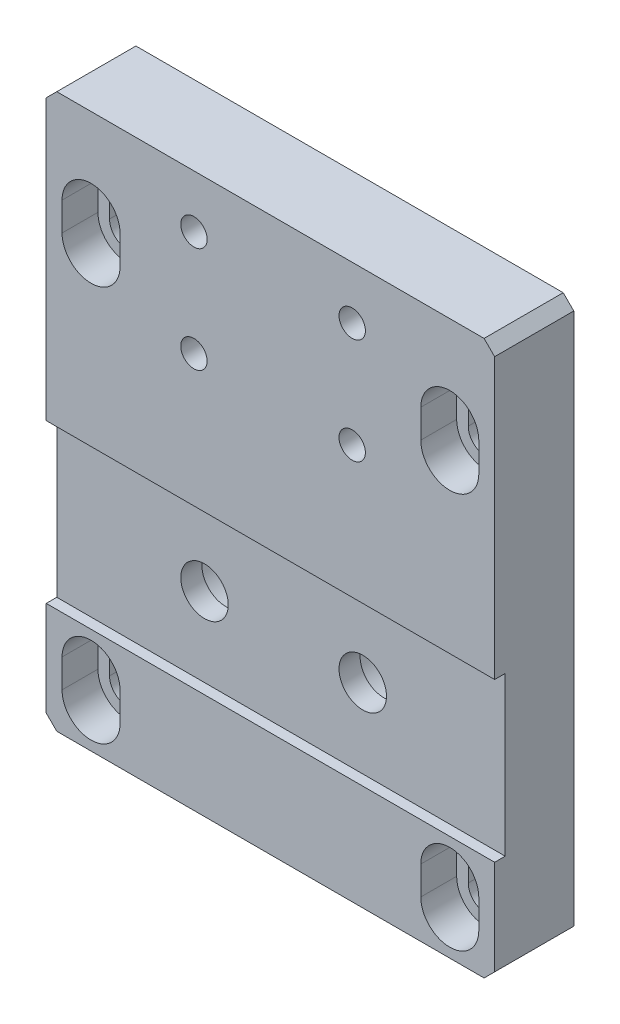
ISO-10303-21;
HEADER;
FILE_DESCRIPTION(('STEP AP214'),'2;1');
FILE_NAME('part.step','',(''),(''),'','','');
FILE_SCHEMA(('AUTOMOTIVE_DESIGN { 1 0 10303 214 1 1 1 1 }'));
ENDSEC;
DATA;
#1=APPLICATION_CONTEXT('core data for automotive mechanical design processes');
#2=APPLICATION_PROTOCOL_DEFINITION('international standard','automotive_design',2000,#1);
#3=PRODUCT_CONTEXT('',#1,'mechanical');
#4=PRODUCT('Part','Part','',(#3));
#5=PRODUCT_RELATED_PRODUCT_CATEGORY('part','',(#4));
#6=PRODUCT_DEFINITION_FORMATION('','',#4);
#7=PRODUCT_DEFINITION_CONTEXT('part definition',#1,'design');
#8=PRODUCT_DEFINITION('design','',#6,#7);
#9=PRODUCT_DEFINITION_SHAPE('','',#8);
#10=(LENGTH_UNIT() NAMED_UNIT(*) SI_UNIT(.MILLI.,.METRE.));
#11=(NAMED_UNIT(*) PLANE_ANGLE_UNIT() SI_UNIT($,.RADIAN.));
#12=(NAMED_UNIT(*) SI_UNIT($,.STERADIAN.) SOLID_ANGLE_UNIT());
#13=UNCERTAINTY_MEASURE_WITH_UNIT(LENGTH_MEASURE(1.E-05),#10,'distance_accuracy_value','');
#14=(GEOMETRIC_REPRESENTATION_CONTEXT(3) GLOBAL_UNCERTAINTY_ASSIGNED_CONTEXT((#13)) GLOBAL_UNIT_ASSIGNED_CONTEXT((#10,
#11,#12)) REPRESENTATION_CONTEXT('',''));
#15=CARTESIAN_POINT('',(0.,0.,0.));
#16=DIRECTION('',(0.,0.,1.));
#17=DIRECTION('',(1.,0.,0.));
#18=AXIS2_PLACEMENT_3D('',#15,#16,#17);
#19=CARTESIAN_POINT('',(0.,0.,15.));
#20=DIRECTION('',(0.,0.,-1.));
#21=DIRECTION('',(-1.,0.,0.));
#22=AXIS2_PLACEMENT_3D('',#19,#20,#21);
#23=PLANE('',#22);
#24=DIRECTION('',(-1.,0.,0.));
#25=VECTOR('',#24,1.);
#26=CARTESIAN_POINT('',(-42.5,52.5,15.));
#27=LINE('',#26,#25);
#28=CARTESIAN_POINT('',(40.5,52.5,15.));
#29=VERTEX_POINT('',#28);
#30=CARTESIAN_POINT('',(-40.5,52.5,15.));
#31=VERTEX_POINT('',#30);
#32=EDGE_CURVE('E622',#29,#31,#27,.T.);
#33=ORIENTED_EDGE('',*,*,#32,.T.);
#34=DIRECTION('',(0.70710678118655,0.707106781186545,0.));
#35=VECTOR('',#34,1.);
#36=CARTESIAN_POINT('',(-42.5,50.5,15.));
#37=LINE('',#36,#35);
#38=CARTESIAN_POINT('',(-42.5,50.5,15.));
#39=VERTEX_POINT('',#38);
#40=EDGE_CURVE('E665',#31,#39,#37,.F.);
#41=ORIENTED_EDGE('',*,*,#40,.T.);
#42=DIRECTION('',(0.,-1.,0.));
#43=VECTOR('',#42,1.);
#44=CARTESIAN_POINT('',(-42.5,-52.5,15.));
#45=LINE('',#44,#43);
#46=CARTESIAN_POINT('',(-42.5,-2.5,15.));
#47=VERTEX_POINT('',#46);
#48=EDGE_CURVE('E627',#39,#47,#45,.T.);
#49=ORIENTED_EDGE('',*,*,#48,.T.);
#50=DIRECTION('',(1.,0.,0.));
#51=VECTOR('',#50,1.);
#52=CARTESIAN_POINT('',(-42.5,-2.5,15.));
#53=LINE('',#52,#51);
#54=CARTESIAN_POINT('',(42.5,-2.5,15.));
#55=VERTEX_POINT('',#54);
#56=EDGE_CURVE('E610',#47,#55,#53,.T.);
#57=ORIENTED_EDGE('',*,*,#56,.T.);
#58=DIRECTION('',(0.,1.,0.));
#59=VECTOR('',#58,1.);
#60=CARTESIAN_POINT('',(42.5,-52.5,15.));
#61=LINE('',#60,#59);
#62=CARTESIAN_POINT('',(42.5,50.5,15.));
#63=VERTEX_POINT('',#62);
#64=EDGE_CURVE('E623',#55,#63,#61,.T.);
#65=ORIENTED_EDGE('',*,*,#64,.T.);
#66=DIRECTION('',(0.707106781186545,-0.70710678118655,0.));
#67=VECTOR('',#66,1.);
#68=CARTESIAN_POINT('',(40.5,52.5,15.));
#69=LINE('',#68,#67);
#70=EDGE_CURVE('E663',#63,#29,#69,.F.);
#71=ORIENTED_EDGE('',*,*,#70,.T.);
#72=EDGE_LOOP('',(#33,#41,#49,#57,#65,#71));
#73=FACE_BOUND('',#72,.T.);
#74=CARTESIAN_POINT('',(15.4999976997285,22.5,15.));
#75=DIRECTION('',(0.,0.,1.));
#76=DIRECTION('',(1.,0.,0.));
#77=AXIS2_PLACEMENT_3D('',#74,#75,#76);
#78=CIRCLE('',#77,2.5);
#79=CARTESIAN_POINT('',(17.9999976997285,22.5,15.));
#80=VERTEX_POINT('',#79);
#81=EDGE_CURVE('E566',#80,#80,#78,.T.);
#82=ORIENTED_EDGE('',*,*,#81,.F.);
#83=EDGE_LOOP('',(#82));
#84=FACE_BOUND('',#83,.T.);
#85=CARTESIAN_POINT('',(15.4999976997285,42.5,15.));
#86=DIRECTION('',(0.,0.,1.));
#87=DIRECTION('',(1.,0.,0.));
#88=AXIS2_PLACEMENT_3D('',#85,#86,#87);
#89=CIRCLE('',#88,2.5);
#90=CARTESIAN_POINT('',(17.9999976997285,42.5,15.));
#91=VERTEX_POINT('',#90);
#92=EDGE_CURVE('E560',#91,#91,#89,.T.);
#93=ORIENTED_EDGE('',*,*,#92,.F.);
#94=EDGE_LOOP('',(#93));
#95=FACE_BOUND('',#94,.T.);
#96=CARTESIAN_POINT('',(-14.5000023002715,42.5,15.));
#97=DIRECTION('',(0.,0.,1.));
#98=DIRECTION('',(1.,0.,0.));
#99=AXIS2_PLACEMENT_3D('',#96,#97,#98);
#100=CIRCLE('',#99,2.5);
#101=CARTESIAN_POINT('',(-12.0000023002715,42.5,15.));
#102=VERTEX_POINT('',#101);
#103=EDGE_CURVE('E554',#102,#102,#100,.T.);
#104=ORIENTED_EDGE('',*,*,#103,.F.);
#105=EDGE_LOOP('',(#104));
#106=FACE_BOUND('',#105,.T.);
#107=CARTESIAN_POINT('',(-14.5000023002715,22.5,15.));
#108=DIRECTION('',(0.,0.,1.));
#109=DIRECTION('',(1.,0.,0.));
#110=AXIS2_PLACEMENT_3D('',#107,#108,#109);
#111=CIRCLE('',#110,2.5);
#112=CARTESIAN_POINT('',(-12.0000023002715,22.5,15.));
#113=VERTEX_POINT('',#112);
#114=EDGE_CURVE('E548',#113,#113,#111,.T.);
#115=ORIENTED_EDGE('',*,*,#114,.F.);
#116=EDGE_LOOP('',(#115));
#117=FACE_BOUND('',#116,.T.);
#118=DIRECTION('',(0.,-1.,0.));
#119=VECTOR('',#118,1.);
#120=CARTESIAN_POINT('',(39.5,35.2,15.));
#121=LINE('',#120,#119);
#122=CARTESIAN_POINT('',(39.5,35.2,15.));
#123=VERTEX_POINT('',#122);
#124=CARTESIAN_POINT('',(39.5,29.8,15.));
#125=VERTEX_POINT('',#124);
#126=EDGE_CURVE('E501',#123,#125,#121,.T.);
#127=ORIENTED_EDGE('',*,*,#126,.T.);
#128=CARTESIAN_POINT('',(34.,29.8,15.));
#129=DIRECTION('',(0.,0.,1.));
#130=DIRECTION('',(1.,0.,0.));
#131=AXIS2_PLACEMENT_3D('',#128,#129,#130);
#132=CIRCLE('',#131,5.5);
#133=CARTESIAN_POINT('',(28.5,29.8,15.));
#134=VERTEX_POINT('',#133);
#135=EDGE_CURVE('E534',#134,#125,#132,.T.);
#136=ORIENTED_EDGE('',*,*,#135,.F.);
#137=DIRECTION('',(0.,-1.,0.));
#138=VECTOR('',#137,1.);
#139=CARTESIAN_POINT('',(28.5,35.2,15.));
#140=LINE('',#139,#138);
#141=CARTESIAN_POINT('',(28.5,35.2,15.));
#142=VERTEX_POINT('',#141);
#143=EDGE_CURVE('E484',#142,#134,#140,.T.);
#144=ORIENTED_EDGE('',*,*,#143,.F.);
#145=CARTESIAN_POINT('',(34.,35.2,15.));
#146=DIRECTION('',(0.,0.,1.));
#147=DIRECTION('',(1.,0.,0.));
#148=AXIS2_PLACEMENT_3D('',#145,#146,#147);
#149=CIRCLE('',#148,5.5);
#150=EDGE_CURVE('E513',#123,#142,#149,.T.);
#151=ORIENTED_EDGE('',*,*,#150,.F.);
#152=EDGE_LOOP('',(#127,#136,#144,#151));
#153=FACE_BOUND('',#152,.T.);
#154=CARTESIAN_POINT('',(-34.,29.8,15.));
#155=DIRECTION('',(0.,0.,1.));
#156=DIRECTION('',(1.,0.,0.));
#157=AXIS2_PLACEMENT_3D('',#154,#155,#156);
#158=CIRCLE('',#157,5.5);
#159=CARTESIAN_POINT('',(-39.5,29.8,15.));
#160=VERTEX_POINT('',#159);
#161=CARTESIAN_POINT('',(-28.5,29.8,15.));
#162=VERTEX_POINT('',#161);
#163=EDGE_CURVE('E344',#160,#162,#158,.T.);
#164=ORIENTED_EDGE('',*,*,#163,.F.);
#165=DIRECTION('',(0.,-1.,0.));
#166=VECTOR('',#165,1.);
#167=CARTESIAN_POINT('',(-39.5,35.2,15.));
#168=LINE('',#167,#166);
#169=CARTESIAN_POINT('',(-39.5,35.2,15.));
#170=VERTEX_POINT('',#169);
#171=EDGE_CURVE('E1353',#170,#160,#168,.T.);
#172=ORIENTED_EDGE('',*,*,#171,.F.);
#173=CARTESIAN_POINT('',(-34.,35.2,15.));
#174=DIRECTION('',(0.,0.,1.));
#175=DIRECTION('',(1.,0.,0.));
#176=AXIS2_PLACEMENT_3D('',#173,#174,#175);
#177=CIRCLE('',#176,5.5);
#178=CARTESIAN_POINT('',(-28.5,35.2,15.));
#179=VERTEX_POINT('',#178);
#180=EDGE_CURVE('E318',#179,#170,#177,.T.);
#181=ORIENTED_EDGE('',*,*,#180,.F.);
#182=DIRECTION('',(0.,-1.,0.));
#183=VECTOR('',#182,1.);
#184=CARTESIAN_POINT('',(-28.5,35.2,15.));
#185=LINE('',#184,#183);
#186=EDGE_CURVE('E307',#179,#162,#185,.T.);
#187=ORIENTED_EDGE('',*,*,#186,.T.);
#188=EDGE_LOOP('',(#164,#172,#181,#187));
#189=FACE_BOUND('',#188,.T.);
#190=ADVANCED_FACE('F16',(#73,#84,#95,#106,#117,#153,#189),#23,.F.);
#191=CARTESIAN_POINT('',(0.,0.,0.));
#192=DIRECTION('',(0.,0.,-1.));
#193=DIRECTION('',(-1.,0.,0.));
#194=AXIS2_PLACEMENT_3D('',#191,#192,#193);
#195=PLANE('',#194);
#196=CARTESIAN_POINT('',(-34.,-45.2,0.));
#197=DIRECTION('',(0.,0.,1.));
#198=DIRECTION('',(1.,0.,0.));
#199=AXIS2_PLACEMENT_3D('',#196,#197,#198);
#200=CIRCLE('',#199,3.3);
#201=CARTESIAN_POINT('',(-37.3,-45.2,0.));
#202=VERTEX_POINT('',#201);
#203=CARTESIAN_POINT('',(-30.7,-45.2,0.));
#204=VERTEX_POINT('',#203);
#205=EDGE_CURVE('E414',#202,#204,#200,.T.);
#206=ORIENTED_EDGE('',*,*,#205,.T.);
#207=DIRECTION('',(0.,-1.,0.));
#208=VECTOR('',#207,1.);
#209=CARTESIAN_POINT('',(-30.7,-39.8,0.));
#210=LINE('',#209,#208);
#211=CARTESIAN_POINT('',(-30.7,-39.8,0.));
#212=VERTEX_POINT('',#211);
#213=EDGE_CURVE('E365',#212,#204,#210,.T.);
#214=ORIENTED_EDGE('',*,*,#213,.F.);
#215=CARTESIAN_POINT('',(-34.,-39.8,0.));
#216=DIRECTION('',(0.,0.,1.));
#217=DIRECTION('',(1.,0.,0.));
#218=AXIS2_PLACEMENT_3D('',#215,#216,#217);
#219=CIRCLE('',#218,3.3);
#220=CARTESIAN_POINT('',(-37.3,-39.8,0.));
#221=VERTEX_POINT('',#220);
#222=EDGE_CURVE('E393',#212,#221,#219,.T.);
#223=ORIENTED_EDGE('',*,*,#222,.T.);
#224=DIRECTION('',(0.,-1.,0.));
#225=VECTOR('',#224,1.);
#226=CARTESIAN_POINT('',(-37.3,-39.8,0.));
#227=LINE('',#226,#225);
#228=EDGE_CURVE('E362',#221,#202,#227,.T.);
#229=ORIENTED_EDGE('',*,*,#228,.T.);
#230=EDGE_LOOP('',(#206,#214,#223,#229));
#231=FACE_BOUND('',#230,.T.);
#232=DIRECTION('',(0.,-1.,0.));
#233=VECTOR('',#232,1.);
#234=CARTESIAN_POINT('',(37.3,-39.8,0.));
#235=LINE('',#234,#233);
#236=CARTESIAN_POINT('',(37.3,-39.8,0.));
#237=VERTEX_POINT('',#236);
#238=CARTESIAN_POINT('',(37.3,-45.2,0.));
#239=VERTEX_POINT('',#238);
#240=EDGE_CURVE('E429',#237,#239,#235,.T.);
#241=ORIENTED_EDGE('',*,*,#240,.F.);
#242=CARTESIAN_POINT('',(34.,-39.8,0.));
#243=DIRECTION('',(0.,0.,1.));
#244=DIRECTION('',(1.,0.,0.));
#245=AXIS2_PLACEMENT_3D('',#242,#243,#244);
#246=CIRCLE('',#245,3.3);
#247=CARTESIAN_POINT('',(30.7,-39.8,0.));
#248=VERTEX_POINT('',#247);
#249=EDGE_CURVE('E457',#237,#248,#246,.T.);
#250=ORIENTED_EDGE('',*,*,#249,.T.);
#251=DIRECTION('',(0.,-1.,0.));
#252=VECTOR('',#251,1.);
#253=CARTESIAN_POINT('',(30.7,-39.8,0.));
#254=LINE('',#253,#252);
#255=CARTESIAN_POINT('',(30.7,-45.2,0.));
#256=VERTEX_POINT('',#255);
#257=EDGE_CURVE('E426',#248,#256,#254,.T.);
#258=ORIENTED_EDGE('',*,*,#257,.T.);
#259=CARTESIAN_POINT('',(34.,-45.2,0.));
#260=DIRECTION('',(0.,0.,1.));
#261=DIRECTION('',(1.,0.,0.));
#262=AXIS2_PLACEMENT_3D('',#259,#260,#261);
#263=CIRCLE('',#262,3.3);
#264=EDGE_CURVE('E478',#256,#239,#263,.T.);
#265=ORIENTED_EDGE('',*,*,#264,.T.);
#266=EDGE_LOOP('',(#241,#250,#258,#265));
#267=FACE_BOUND('',#266,.T.);
#268=DIRECTION('',(0.,-1.,0.));
#269=VECTOR('',#268,1.);
#270=CARTESIAN_POINT('',(37.3,35.2,0.));
#271=LINE('',#270,#269);
#272=CARTESIAN_POINT('',(37.3,35.2,0.));
#273=VERTEX_POINT('',#272);
#274=CARTESIAN_POINT('',(37.3,29.8,0.));
#275=VERTEX_POINT('',#274);
#276=EDGE_CURVE('E493',#273,#275,#271,.T.);
#277=ORIENTED_EDGE('',*,*,#276,.F.);
#278=CARTESIAN_POINT('',(34.,35.2,0.));
#279=DIRECTION('',(0.,0.,1.));
#280=DIRECTION('',(1.,0.,0.));
#281=AXIS2_PLACEMENT_3D('',#278,#279,#280);
#282=CIRCLE('',#281,3.3);
#283=CARTESIAN_POINT('',(30.7,35.2,0.));
#284=VERTEX_POINT('',#283);
#285=EDGE_CURVE('E521',#273,#284,#282,.T.);
#286=ORIENTED_EDGE('',*,*,#285,.T.);
#287=DIRECTION('',(0.,-1.,0.));
#288=VECTOR('',#287,1.);
#289=CARTESIAN_POINT('',(30.7,35.2,0.));
#290=LINE('',#289,#288);
#291=CARTESIAN_POINT('',(30.7,29.8,0.));
#292=VERTEX_POINT('',#291);
#293=EDGE_CURVE('E490',#284,#292,#290,.T.);
#294=ORIENTED_EDGE('',*,*,#293,.T.);
#295=CARTESIAN_POINT('',(34.,29.8,0.));
#296=DIRECTION('',(0.,0.,1.));
#297=DIRECTION('',(1.,0.,0.));
#298=AXIS2_PLACEMENT_3D('',#295,#296,#297);
#299=CIRCLE('',#298,3.3);
#300=EDGE_CURVE('E542',#292,#275,#299,.T.);
#301=ORIENTED_EDGE('',*,*,#300,.T.);
#302=EDGE_LOOP('',(#277,#286,#294,#301));
#303=FACE_BOUND('',#302,.T.);
#304=CARTESIAN_POINT('',(-14.5000023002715,22.5,0.));
#305=DIRECTION('',(0.,0.,1.));
#306=DIRECTION('',(1.,0.,0.));
#307=AXIS2_PLACEMENT_3D('',#304,#305,#306);
#308=CIRCLE('',#307,2.5);
#309=CARTESIAN_POINT('',(-12.0000023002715,22.5,0.));
#310=VERTEX_POINT('',#309);
#311=EDGE_CURVE('E551',#310,#310,#308,.T.);
#312=ORIENTED_EDGE('',*,*,#311,.T.);
#313=EDGE_LOOP('',(#312));
#314=FACE_BOUND('',#313,.T.);
#315=CARTESIAN_POINT('',(-14.5000023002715,42.5,0.));
#316=DIRECTION('',(0.,0.,1.));
#317=DIRECTION('',(1.,0.,0.));
#318=AXIS2_PLACEMENT_3D('',#315,#316,#317);
#319=CIRCLE('',#318,2.5);
#320=CARTESIAN_POINT('',(-12.0000023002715,42.5,0.));
#321=VERTEX_POINT('',#320);
#322=EDGE_CURVE('E557',#321,#321,#319,.T.);
#323=ORIENTED_EDGE('',*,*,#322,.T.);
#324=EDGE_LOOP('',(#323));
#325=FACE_BOUND('',#324,.T.);
#326=CARTESIAN_POINT('',(15.4999976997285,42.5,0.));
#327=DIRECTION('',(0.,0.,1.));
#328=DIRECTION('',(1.,0.,0.));
#329=AXIS2_PLACEMENT_3D('',#326,#327,#328);
#330=CIRCLE('',#329,2.5);
#331=CARTESIAN_POINT('',(17.9999976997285,42.5,0.));
#332=VERTEX_POINT('',#331);
#333=EDGE_CURVE('E563',#332,#332,#330,.T.);
#334=ORIENTED_EDGE('',*,*,#333,.T.);
#335=EDGE_LOOP('',(#334));
#336=FACE_BOUND('',#335,.T.);
#337=CARTESIAN_POINT('',(15.4999976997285,22.5,0.));
#338=DIRECTION('',(0.,0.,1.));
#339=DIRECTION('',(1.,0.,0.));
#340=AXIS2_PLACEMENT_3D('',#337,#338,#339);
#341=CIRCLE('',#340,2.5);
#342=CARTESIAN_POINT('',(17.9999976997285,22.5,0.));
#343=VERTEX_POINT('',#342);
#344=EDGE_CURVE('E569',#343,#343,#341,.T.);
#345=ORIENTED_EDGE('',*,*,#344,.T.);
#346=EDGE_LOOP('',(#345));
#347=FACE_BOUND('',#346,.T.);
#348=CARTESIAN_POINT('',(-14.5,-17.5,0.));
#349=DIRECTION('',(0.,0.,-1.));
#350=DIRECTION('',(-1.,0.,0.));
#351=AXIS2_PLACEMENT_3D('',#348,#349,#350);
#352=CIRCLE('',#351,7.5);
#353=CARTESIAN_POINT('',(-22.,-17.5,0.));
#354=VERTEX_POINT('',#353);
#355=EDGE_CURVE('E572',#354,#354,#352,.T.);
#356=ORIENTED_EDGE('',*,*,#355,.F.);
#357=EDGE_LOOP('',(#356));
#358=FACE_BOUND('',#357,.T.);
#359=CARTESIAN_POINT('',(15.5,-17.5,0.));
#360=DIRECTION('',(0.,0.,-1.));
#361=DIRECTION('',(-1.,0.,0.));
#362=AXIS2_PLACEMENT_3D('',#359,#360,#361);
#363=CIRCLE('',#362,7.5);
#364=CARTESIAN_POINT('',(8.,-17.5,0.));
#365=VERTEX_POINT('',#364);
#366=EDGE_CURVE('E582',#365,#365,#363,.T.);
#367=ORIENTED_EDGE('',*,*,#366,.F.);
#368=EDGE_LOOP('',(#367));
#369=FACE_BOUND('',#368,.T.);
#370=DIRECTION('',(0.,-1.,0.));
#371=VECTOR('',#370,1.);
#372=CARTESIAN_POINT('',(-42.5,-52.5,0.));
#373=LINE('',#372,#371);
#374=CARTESIAN_POINT('',(-42.5,50.5,0.));
#375=VERTEX_POINT('',#374);
#376=CARTESIAN_POINT('',(-42.5,-50.5,0.));
#377=VERTEX_POINT('',#376);
#378=EDGE_CURVE('E637',#375,#377,#373,.T.);
#379=ORIENTED_EDGE('',*,*,#378,.F.);
#380=DIRECTION('',(-0.70710678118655,-0.707106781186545,0.));
#381=VECTOR('',#380,1.);
#382=CARTESIAN_POINT('',(-46.5,46.5,0.));
#383=LINE('',#382,#381);
#384=CARTESIAN_POINT('',(-40.5,52.5,0.));
#385=VERTEX_POINT('',#384);
#386=EDGE_CURVE('E656',#375,#385,#383,.F.);
#387=ORIENTED_EDGE('',*,*,#386,.T.);
#388=DIRECTION('',(-1.,0.,0.));
#389=VECTOR('',#388,1.);
#390=CARTESIAN_POINT('',(-42.5,52.5,0.));
#391=LINE('',#390,#389);
#392=CARTESIAN_POINT('',(40.5,52.5,0.));
#393=VERTEX_POINT('',#392);
#394=EDGE_CURVE('E634',#393,#385,#391,.T.);
#395=ORIENTED_EDGE('',*,*,#394,.F.);
#396=DIRECTION('',(-0.707106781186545,0.70710678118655,0.));
#397=VECTOR('',#396,1.);
#398=CARTESIAN_POINT('',(46.5,46.5,0.));
#399=LINE('',#398,#397);
#400=CARTESIAN_POINT('',(42.5,50.5,0.));
#401=VERTEX_POINT('',#400);
#402=EDGE_CURVE('E654',#393,#401,#399,.F.);
#403=ORIENTED_EDGE('',*,*,#402,.T.);
#404=DIRECTION('',(0.,1.,0.));
#405=VECTOR('',#404,1.);
#406=CARTESIAN_POINT('',(42.5,-52.5,0.));
#407=LINE('',#406,#405);
#408=CARTESIAN_POINT('',(42.5,-50.5,0.));
#409=VERTEX_POINT('',#408);
#410=EDGE_CURVE('E613',#409,#401,#407,.T.);
#411=ORIENTED_EDGE('',*,*,#410,.F.);
#412=DIRECTION('',(0.70710678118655,0.707106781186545,0.));
#413=VECTOR('',#412,1.);
#414=CARTESIAN_POINT('',(46.5,-46.5,0.));
#415=LINE('',#414,#413);
#416=CARTESIAN_POINT('',(40.5,-52.5,0.));
#417=VERTEX_POINT('',#416);
#418=EDGE_CURVE('E650',#409,#417,#415,.F.);
#419=ORIENTED_EDGE('',*,*,#418,.T.);
#420=DIRECTION('',(1.,0.,0.));
#421=VECTOR('',#420,1.);
#422=CARTESIAN_POINT('',(-42.5,-52.5,0.));
#423=LINE('',#422,#421);
#424=CARTESIAN_POINT('',(-40.5,-52.5,0.));
#425=VERTEX_POINT('',#424);
#426=EDGE_CURVE('E640',#425,#417,#423,.T.);
#427=ORIENTED_EDGE('',*,*,#426,.F.);
#428=DIRECTION('',(0.707106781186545,-0.70710678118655,0.));
#429=VECTOR('',#428,1.);
#430=CARTESIAN_POINT('',(-46.5,-46.5,0.));
#431=LINE('',#430,#429);
#432=EDGE_CURVE('E652',#425,#377,#431,.F.);
#433=ORIENTED_EDGE('',*,*,#432,.T.);
#434=EDGE_LOOP('',(#379,#387,#395,#403,#411,#419,#427,#433));
#435=FACE_BOUND('',#434,.T.);
#436=CARTESIAN_POINT('',(-34.,35.2,0.));
#437=DIRECTION('',(0.,0.,1.));
#438=DIRECTION('',(1.,0.,0.));
#439=AXIS2_PLACEMENT_3D('',#436,#437,#438);
#440=CIRCLE('',#439,3.3);
#441=CARTESIAN_POINT('',(-30.7,35.2,0.));
#442=VERTEX_POINT('',#441);
#443=CARTESIAN_POINT('',(-37.3,35.2,0.));
#444=VERTEX_POINT('',#443);
#445=EDGE_CURVE('E334',#442,#444,#440,.T.);
#446=ORIENTED_EDGE('',*,*,#445,.T.);
#447=DIRECTION('',(0.,-1.,0.));
#448=VECTOR('',#447,1.);
#449=CARTESIAN_POINT('',(-37.3,35.2,0.));
#450=LINE('',#449,#448);
#451=CARTESIAN_POINT('',(-37.3,29.8,0.));
#452=VERTEX_POINT('',#451);
#453=EDGE_CURVE('E1361',#444,#452,#450,.T.);
#454=ORIENTED_EDGE('',*,*,#453,.T.);
#455=CARTESIAN_POINT('',(-34.,29.8,0.));
#456=DIRECTION('',(0.,0.,1.));
#457=DIRECTION('',(1.,0.,0.));
#458=AXIS2_PLACEMENT_3D('',#455,#456,#457);
#459=CIRCLE('',#458,3.3);
#460=CARTESIAN_POINT('',(-30.7,29.8,0.));
#461=VERTEX_POINT('',#460);
#462=EDGE_CURVE('E350',#452,#461,#459,.T.);
#463=ORIENTED_EDGE('',*,*,#462,.T.);
#464=DIRECTION('',(0.,-1.,0.));
#465=VECTOR('',#464,1.);
#466=CARTESIAN_POINT('',(-30.7,35.2,0.));
#467=LINE('',#466,#465);
#468=EDGE_CURVE('E1364',#442,#461,#467,.T.);
#469=ORIENTED_EDGE('',*,*,#468,.F.);
#470=EDGE_LOOP('',(#446,#454,#463,#469));
#471=FACE_BOUND('',#470,.T.);
#472=ADVANCED_FACE('F690',(#231,#267,#303,#314,#325,#336,#347,#358,#369,#435,#471),#195,.T.);
#473=CARTESIAN_POINT('',(-34.,-39.8,15.));
#474=DIRECTION('',(0.,0.,1.));
#475=DIRECTION('',(1.,0.,0.));
#476=AXIS2_PLACEMENT_3D('',#473,#474,#475);
#477=CIRCLE('',#476,5.5);
#478=CARTESIAN_POINT('',(-28.5,-39.8,15.));
#479=VERTEX_POINT('',#478);
#480=CARTESIAN_POINT('',(-39.5,-39.8,15.));
#481=VERTEX_POINT('',#480);
#482=EDGE_CURVE('E385',#479,#481,#477,.T.);
#483=ORIENTED_EDGE('',*,*,#482,.F.);
#484=DIRECTION('',(0.,-1.,0.));
#485=VECTOR('',#484,1.);
#486=CARTESIAN_POINT('',(-28.5,-39.8,15.));
#487=LINE('',#486,#485);
#488=CARTESIAN_POINT('',(-28.5,-45.2,15.));
#489=VERTEX_POINT('',#488);
#490=EDGE_CURVE('E373',#479,#489,#487,.T.);
#491=ORIENTED_EDGE('',*,*,#490,.T.);
#492=CARTESIAN_POINT('',(-34.,-45.2,15.));
#493=DIRECTION('',(0.,0.,1.));
#494=DIRECTION('',(1.,0.,0.));
#495=AXIS2_PLACEMENT_3D('',#492,#493,#494);
#496=CIRCLE('',#495,5.5);
#497=CARTESIAN_POINT('',(-39.5,-45.2,15.));
#498=VERTEX_POINT('',#497);
#499=EDGE_CURVE('E406',#498,#489,#496,.T.);
#500=ORIENTED_EDGE('',*,*,#499,.F.);
#501=DIRECTION('',(0.,-1.,0.));
#502=VECTOR('',#501,1.);
#503=CARTESIAN_POINT('',(-39.5,-39.8,15.));
#504=LINE('',#503,#502);
#505=EDGE_CURVE('E356',#481,#498,#504,.T.);
#506=ORIENTED_EDGE('',*,*,#505,.F.);
#507=EDGE_LOOP('',(#483,#491,#500,#506));
#508=FACE_BOUND('',#507,.T.);
#509=CARTESIAN_POINT('',(-42.5,-32.5,15.));
#510=VERTEX_POINT('',#509);
#511=CARTESIAN_POINT('',(-42.5,-50.5,15.));
#512=VERTEX_POINT('',#511);
#513=EDGE_CURVE('E626',#510,#512,#45,.T.);
#514=ORIENTED_EDGE('',*,*,#513,.T.);
#515=DIRECTION('',(-0.707106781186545,0.70710678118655,0.));
#516=VECTOR('',#515,1.);
#517=CARTESIAN_POINT('',(-40.5,-52.5,15.));
#518=LINE('',#517,#516);
#519=CARTESIAN_POINT('',(-40.5,-52.5,15.));
#520=VERTEX_POINT('',#519);
#521=EDGE_CURVE('E11',#512,#520,#518,.F.);
#522=ORIENTED_EDGE('',*,*,#521,.T.);
#523=DIRECTION('',(1.,0.,0.));
#524=VECTOR('',#523,1.);
#525=CARTESIAN_POINT('',(-42.5,-52.5,15.));
#526=LINE('',#525,#524);
#527=CARTESIAN_POINT('',(40.5,-52.5,15.));
#528=VERTEX_POINT('',#527);
#529=EDGE_CURVE('E629',#520,#528,#526,.T.);
#530=ORIENTED_EDGE('',*,*,#529,.T.);
#531=DIRECTION('',(-0.70710678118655,-0.707106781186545,0.));
#532=VECTOR('',#531,1.);
#533=CARTESIAN_POINT('',(42.5,-50.5,15.));
#534=LINE('',#533,#532);
#535=CARTESIAN_POINT('',(42.5,-50.5,15.));
#536=VERTEX_POINT('',#535);
#537=EDGE_CURVE('E24',#528,#536,#534,.F.);
#538=ORIENTED_EDGE('',*,*,#537,.T.);
#539=CARTESIAN_POINT('',(42.5,-32.5,15.));
#540=VERTEX_POINT('',#539);
#541=EDGE_CURVE('E620',#536,#540,#61,.T.);
#542=ORIENTED_EDGE('',*,*,#541,.T.);
#543=DIRECTION('',(1.,0.,0.));
#544=VECTOR('',#543,1.);
#545=CARTESIAN_POINT('',(-42.5,-32.5,15.));
#546=LINE('',#545,#544);
#547=EDGE_CURVE('E602',#510,#540,#546,.T.);
#548=ORIENTED_EDGE('',*,*,#547,.F.);
#549=EDGE_LOOP('',(#514,#522,#530,#538,#542,#548));
#550=FACE_BOUND('',#549,.T.);
#551=DIRECTION('',(0.,-1.,0.));
#552=VECTOR('',#551,1.);
#553=CARTESIAN_POINT('',(39.5,-39.8,15.));
#554=LINE('',#553,#552);
#555=CARTESIAN_POINT('',(39.5,-39.8,15.));
#556=VERTEX_POINT('',#555);
#557=CARTESIAN_POINT('',(39.5,-45.2,15.));
#558=VERTEX_POINT('',#557);
#559=EDGE_CURVE('E437',#556,#558,#554,.T.);
#560=ORIENTED_EDGE('',*,*,#559,.T.);
#561=CARTESIAN_POINT('',(34.,-45.2,15.));
#562=DIRECTION('',(0.,0.,1.));
#563=DIRECTION('',(1.,0.,0.));
#564=AXIS2_PLACEMENT_3D('',#561,#562,#563);
#565=CIRCLE('',#564,5.5);
#566=CARTESIAN_POINT('',(28.5,-45.2,15.));
#567=VERTEX_POINT('',#566);
#568=EDGE_CURVE('E470',#567,#558,#565,.T.);
#569=ORIENTED_EDGE('',*,*,#568,.F.);
#570=DIRECTION('',(0.,-1.,0.));
#571=VECTOR('',#570,1.);
#572=CARTESIAN_POINT('',(28.5,-39.8,15.));
#573=LINE('',#572,#571);
#574=CARTESIAN_POINT('',(28.5,-39.8,15.));
#575=VERTEX_POINT('',#574);
#576=EDGE_CURVE('E420',#575,#567,#573,.T.);
#577=ORIENTED_EDGE('',*,*,#576,.F.);
#578=CARTESIAN_POINT('',(34.,-39.8,15.));
#579=DIRECTION('',(0.,0.,1.));
#580=DIRECTION('',(1.,0.,0.));
#581=AXIS2_PLACEMENT_3D('',#578,#579,#580);
#582=CIRCLE('',#581,5.5);
#583=EDGE_CURVE('E449',#556,#575,#582,.T.);
#584=ORIENTED_EDGE('',*,*,#583,.F.);
#585=EDGE_LOOP('',(#560,#569,#577,#584));
#586=FACE_BOUND('',#585,.T.);
#587=ADVANCED_FACE('F677',(#508,#550,#586),#23,.F.);
#588=CARTESIAN_POINT('',(42.5,-52.5,15.));
#589=DIRECTION('',(-1.,0.,0.));
#590=DIRECTION('',(0.,0.,1.));
#591=AXIS2_PLACEMENT_3D('',#588,#589,#590);
#592=PLANE('',#591);
#593=ORIENTED_EDGE('',*,*,#410,.T.);
#594=DIRECTION('',(0.,0.,1.));
#595=VECTOR('',#594,1.);
#596=CARTESIAN_POINT('',(42.5,50.5,15.));
#597=LINE('',#596,#595);
#598=EDGE_CURVE('E670',#401,#63,#597,.T.);
#599=ORIENTED_EDGE('',*,*,#598,.T.);
#600=ORIENTED_EDGE('',*,*,#64,.F.);
#601=DIRECTION('',(0.,0.,1.));
#602=VECTOR('',#601,1.);
#603=CARTESIAN_POINT('',(42.5,-2.5,15.));
#604=LINE('',#603,#602);
#605=CARTESIAN_POINT('',(42.5,-2.5,13.));
#606=VERTEX_POINT('',#605);
#607=EDGE_CURVE('E596',#606,#55,#604,.T.);
#608=ORIENTED_EDGE('',*,*,#607,.F.);
#609=DIRECTION('',(0.,1.,0.));
#610=VECTOR('',#609,1.);
#611=CARTESIAN_POINT('',(42.5,-2.5,13.));
#612=LINE('',#611,#610);
#613=CARTESIAN_POINT('',(42.5,-32.5,13.));
#614=VERTEX_POINT('',#613);
#615=EDGE_CURVE('E606',#614,#606,#612,.T.);
#616=ORIENTED_EDGE('',*,*,#615,.F.);
#617=DIRECTION('',(0.,0.,-1.));
#618=VECTOR('',#617,1.);
#619=CARTESIAN_POINT('',(42.5,-32.5,15.));
#620=LINE('',#619,#618);
#621=EDGE_CURVE('E603',#540,#614,#620,.T.);
#622=ORIENTED_EDGE('',*,*,#621,.F.);
#623=ORIENTED_EDGE('',*,*,#541,.F.);
#624=DIRECTION('',(0.,0.,-1.));
#625=VECTOR('',#624,1.);
#626=CARTESIAN_POINT('',(42.5,-50.5,15.));
#627=LINE('',#626,#625);
#628=EDGE_CURVE('E667',#536,#409,#627,.T.);
#629=ORIENTED_EDGE('',*,*,#628,.T.);
#630=EDGE_LOOP('',(#593,#599,#600,#608,#616,#622,#623,#629));
#631=FACE_BOUND('',#630,.T.);
#632=ADVANCED_FACE('F684',(#631),#592,.F.);
#633=CARTESIAN_POINT('',(-42.5,52.5,15.));
#634=DIRECTION('',(0.,-1.,0.));
#635=DIRECTION('',(0.,0.,-1.));
#636=AXIS2_PLACEMENT_3D('',#633,#634,#635);
#637=PLANE('',#636);
#638=ORIENTED_EDGE('',*,*,#394,.T.);
#639=DIRECTION('',(0.,0.,1.));
#640=VECTOR('',#639,1.);
#641=CARTESIAN_POINT('',(-40.5,52.5,15.));
#642=LINE('',#641,#640);
#643=EDGE_CURVE('E661',#385,#31,#642,.T.);
#644=ORIENTED_EDGE('',*,*,#643,.T.);
#645=ORIENTED_EDGE('',*,*,#32,.F.);
#646=DIRECTION('',(0.,0.,-1.));
#647=VECTOR('',#646,1.);
#648=CARTESIAN_POINT('',(40.5,52.5,15.));
#649=LINE('',#648,#647);
#650=EDGE_CURVE('E658',#29,#393,#649,.T.);
#651=ORIENTED_EDGE('',*,*,#650,.T.);
#652=EDGE_LOOP('',(#638,#644,#645,#651));
#653=FACE_BOUND('',#652,.T.);
#654=ADVANCED_FACE('F708',(#653),#637,.F.);
#655=CARTESIAN_POINT('',(-42.5,-52.5,15.));
#656=DIRECTION('',(1.,0.,0.));
#657=DIRECTION('',(0.,0.,-1.));
#658=AXIS2_PLACEMENT_3D('',#655,#656,#657);
#659=PLANE('',#658);
#660=ORIENTED_EDGE('',*,*,#48,.F.);
#661=DIRECTION('',(0.,0.,-1.));
#662=VECTOR('',#661,1.);
#663=CARTESIAN_POINT('',(-42.5,50.5,15.));
#664=LINE('',#663,#662);
#665=EDGE_CURVE('E647',#39,#375,#664,.T.);
#666=ORIENTED_EDGE('',*,*,#665,.T.);
#667=ORIENTED_EDGE('',*,*,#378,.T.);
#668=DIRECTION('',(0.,0.,1.));
#669=VECTOR('',#668,1.);
#670=CARTESIAN_POINT('',(-42.5,-50.5,15.));
#671=LINE('',#670,#669);
#672=EDGE_CURVE('E631',#377,#512,#671,.T.);
#673=ORIENTED_EDGE('',*,*,#672,.T.);
#674=ORIENTED_EDGE('',*,*,#513,.F.);
#675=DIRECTION('',(0.,0.,-1.));
#676=VECTOR('',#675,1.);
#677=CARTESIAN_POINT('',(-42.5,-32.5,15.));
#678=LINE('',#677,#676);
#679=CARTESIAN_POINT('',(-42.5,-32.5,13.));
#680=VERTEX_POINT('',#679);
#681=EDGE_CURVE('E592',#510,#680,#678,.T.);
#682=ORIENTED_EDGE('',*,*,#681,.T.);
#683=DIRECTION('',(0.,1.,0.));
#684=VECTOR('',#683,1.);
#685=CARTESIAN_POINT('',(-42.5,-2.5,13.));
#686=LINE('',#685,#684);
#687=CARTESIAN_POINT('',(-42.5,-2.5,13.));
#688=VERTEX_POINT('',#687);
#689=EDGE_CURVE('E595',#680,#688,#686,.T.);
#690=ORIENTED_EDGE('',*,*,#689,.T.);
#691=DIRECTION('',(0.,0.,1.));
#692=VECTOR('',#691,1.);
#693=CARTESIAN_POINT('',(-42.5,-2.5,15.));
#694=LINE('',#693,#692);
#695=EDGE_CURVE('E599',#688,#47,#694,.T.);
#696=ORIENTED_EDGE('',*,*,#695,.T.);
#697=EDGE_LOOP('',(#660,#666,#667,#673,#674,#682,#690,#696));
#698=FACE_BOUND('',#697,.T.);
#699=ADVANCED_FACE('F699',(#698),#659,.F.);
#700=CARTESIAN_POINT('',(-42.5,-52.5,15.));
#701=DIRECTION('',(0.,1.,0.));
#702=DIRECTION('',(0.,0.,1.));
#703=AXIS2_PLACEMENT_3D('',#700,#701,#702);
#704=PLANE('',#703);
#705=ORIENTED_EDGE('',*,*,#529,.F.);
#706=DIRECTION('',(0.,0.,-1.));
#707=VECTOR('',#706,1.);
#708=CARTESIAN_POINT('',(-40.5,-52.5,15.));
#709=LINE('',#708,#707);
#710=EDGE_CURVE('E673',#520,#425,#709,.T.);
#711=ORIENTED_EDGE('',*,*,#710,.T.);
#712=ORIENTED_EDGE('',*,*,#426,.T.);
#713=DIRECTION('',(0.,0.,1.));
#714=VECTOR('',#713,1.);
#715=CARTESIAN_POINT('',(40.5,-52.5,15.));
#716=LINE('',#715,#714);
#717=EDGE_CURVE('E31',#417,#528,#716,.T.);
#718=ORIENTED_EDGE('',*,*,#717,.T.);
#719=EDGE_LOOP('',(#705,#711,#712,#718));
#720=FACE_BOUND('',#719,.T.);
#721=ADVANCED_FACE('F692',(#720),#704,.F.);
#722=CARTESIAN_POINT('',(-42.5,-2.5,15.));
#723=DIRECTION('',(0.,1.,0.));
#724=DIRECTION('',(0.,0.,1.));
#725=AXIS2_PLACEMENT_3D('',#722,#723,#724);
#726=PLANE('',#725);
#727=ORIENTED_EDGE('',*,*,#607,.T.);
#728=ORIENTED_EDGE('',*,*,#56,.F.);
#729=ORIENTED_EDGE('',*,*,#695,.F.);
#730=DIRECTION('',(1.,0.,0.));
#731=VECTOR('',#730,1.);
#732=CARTESIAN_POINT('',(-42.5,-2.5,13.));
#733=LINE('',#732,#731);
#734=EDGE_CURVE('E614',#688,#606,#733,.T.);
#735=ORIENTED_EDGE('',*,*,#734,.T.);
#736=EDGE_LOOP('',(#727,#728,#729,#735));
#737=FACE_BOUND('',#736,.T.);
#738=ADVANCED_FACE('F723',(#737),#726,.F.);
#739=CARTESIAN_POINT('',(-42.5,-2.5,13.));
#740=DIRECTION('',(0.,0.,-1.));
#741=DIRECTION('',(0.,1.,0.));
#742=AXIS2_PLACEMENT_3D('',#739,#740,#741);
#743=PLANE('',#742);
#744=CARTESIAN_POINT('',(-14.5,-17.5,13.));
#745=DIRECTION('',(0.,0.,-1.));
#746=DIRECTION('',(0.,1.,0.));
#747=AXIS2_PLACEMENT_3D('',#744,#745,#746);
#748=CIRCLE('',#747,4.5);
#749=CARTESIAN_POINT('',(-14.5,-13.,13.));
#750=VERTEX_POINT('',#749);
#751=EDGE_CURVE('E581',#750,#750,#748,.T.);
#752=ORIENTED_EDGE('',*,*,#751,.T.);
#753=EDGE_LOOP('',(#752));
#754=FACE_BOUND('',#753,.T.);
#755=CARTESIAN_POINT('',(15.5,-17.5,13.));
#756=DIRECTION('',(0.,0.,-1.));
#757=DIRECTION('',(0.,1.,0.));
#758=AXIS2_PLACEMENT_3D('',#755,#756,#757);
#759=CIRCLE('',#758,4.5);
#760=CARTESIAN_POINT('',(15.5,-13.,13.));
#761=VERTEX_POINT('',#760);
#762=EDGE_CURVE('E591',#761,#761,#759,.T.);
#763=ORIENTED_EDGE('',*,*,#762,.T.);
#764=EDGE_LOOP('',(#763));
#765=FACE_BOUND('',#764,.T.);
#766=ORIENTED_EDGE('',*,*,#615,.T.);
#767=ORIENTED_EDGE('',*,*,#734,.F.);
#768=ORIENTED_EDGE('',*,*,#689,.F.);
#769=DIRECTION('',(1.,0.,0.));
#770=VECTOR('',#769,1.);
#771=CARTESIAN_POINT('',(-42.5,-32.5,13.));
#772=LINE('',#771,#770);
#773=EDGE_CURVE('E616',#680,#614,#772,.T.);
#774=ORIENTED_EDGE('',*,*,#773,.T.);
#775=EDGE_LOOP('',(#766,#767,#768,#774));
#776=FACE_BOUND('',#775,.T.);
#777=ADVANCED_FACE('F726',(#754,#765,#776),#743,.F.);
#778=CARTESIAN_POINT('',(-42.5,-32.5,15.));
#779=DIRECTION('',(0.,-1.,0.));
#780=DIRECTION('',(0.,0.,-1.));
#781=AXIS2_PLACEMENT_3D('',#778,#779,#780);
#782=PLANE('',#781);
#783=ORIENTED_EDGE('',*,*,#621,.T.);
#784=ORIENTED_EDGE('',*,*,#773,.F.);
#785=ORIENTED_EDGE('',*,*,#681,.F.);
#786=ORIENTED_EDGE('',*,*,#547,.T.);
#787=EDGE_LOOP('',(#783,#784,#785,#786));
#788=FACE_BOUND('',#787,.T.);
#789=ADVANCED_FACE('F728',(#788),#782,.F.);
#790=CARTESIAN_POINT('',(15.5,-17.5,0.));
#791=DIRECTION('',(0.,0.,-1.));
#792=DIRECTION('',(-1.,0.,0.));
#793=AXIS2_PLACEMENT_3D('',#790,#791,#792);
#794=CYLINDRICAL_SURFACE('',#793,4.5);
#795=CARTESIAN_POINT('',(15.5,-17.5,9.));
#796=DIRECTION('',(0.,0.,-1.));
#797=DIRECTION('',(-1.,0.,0.));
#798=AXIS2_PLACEMENT_3D('',#795,#796,#797);
#799=CIRCLE('',#798,4.5);
#800=CARTESIAN_POINT('',(11.,-17.5,9.));
#801=VERTEX_POINT('',#800);
#802=EDGE_CURVE('E588',#801,#801,#799,.T.);
#803=ORIENTED_EDGE('',*,*,#802,.T.);
#804=EDGE_LOOP('',(#803));
#805=FACE_BOUND('',#804,.T.);
#806=ORIENTED_EDGE('',*,*,#762,.F.);
#807=EDGE_LOOP('',(#806));
#808=FACE_BOUND('',#807,.T.);
#809=ADVANCED_FACE('F730',(#805,#808),#794,.F.);
#810=CARTESIAN_POINT('',(20.,-17.5,9.));
#811=DIRECTION('',(0.,0.,1.));
#812=DIRECTION('',(1.,0.,0.));
#813=AXIS2_PLACEMENT_3D('',#810,#811,#812);
#814=PLANE('',#813);
#815=ORIENTED_EDGE('',*,*,#802,.F.);
#816=EDGE_LOOP('',(#815));
#817=FACE_BOUND('',#816,.T.);
#818=CARTESIAN_POINT('',(15.5,-17.5,9.));
#819=DIRECTION('',(0.,0.,-1.));
#820=DIRECTION('',(-1.,0.,0.));
#821=AXIS2_PLACEMENT_3D('',#818,#819,#820);
#822=CIRCLE('',#821,7.5);
#823=CARTESIAN_POINT('',(8.,-17.5,9.));
#824=VERTEX_POINT('',#823);
#825=EDGE_CURVE('E585',#824,#824,#822,.T.);
#826=ORIENTED_EDGE('',*,*,#825,.T.);
#827=EDGE_LOOP('',(#826));
#828=FACE_BOUND('',#827,.T.);
#829=ADVANCED_FACE('F738',(#817,#828),#814,.F.);
#830=CARTESIAN_POINT('',(15.5,-17.5,0.));
#831=DIRECTION('',(0.,0.,-1.));
#832=DIRECTION('',(-1.,0.,0.));
#833=AXIS2_PLACEMENT_3D('',#830,#831,#832);
#834=CYLINDRICAL_SURFACE('',#833,7.5);
#835=ORIENTED_EDGE('',*,*,#825,.F.);
#836=EDGE_LOOP('',(#835));
#837=FACE_BOUND('',#836,.T.);
#838=ORIENTED_EDGE('',*,*,#366,.T.);
#839=EDGE_LOOP('',(#838));
#840=FACE_BOUND('',#839,.T.);
#841=ADVANCED_FACE('F894',(#837,#840),#834,.F.);
#842=CARTESIAN_POINT('',(-14.5,-17.5,0.));
#843=DIRECTION('',(0.,0.,-1.));
#844=DIRECTION('',(-1.,0.,0.));
#845=AXIS2_PLACEMENT_3D('',#842,#843,#844);
#846=CYLINDRICAL_SURFACE('',#845,4.5);
#847=CARTESIAN_POINT('',(-14.5,-17.5,9.));
#848=DIRECTION('',(0.,0.,-1.));
#849=DIRECTION('',(-1.,0.,0.));
#850=AXIS2_PLACEMENT_3D('',#847,#848,#849);
#851=CIRCLE('',#850,4.5);
#852=CARTESIAN_POINT('',(-19.,-17.5,9.));
#853=VERTEX_POINT('',#852);
#854=EDGE_CURVE('E578',#853,#853,#851,.T.);
#855=ORIENTED_EDGE('',*,*,#854,.T.);
#856=EDGE_LOOP('',(#855));
#857=FACE_BOUND('',#856,.T.);
#858=ORIENTED_EDGE('',*,*,#751,.F.);
#859=EDGE_LOOP('',(#858));
#860=FACE_BOUND('',#859,.T.);
#861=ADVANCED_FACE('F890',(#857,#860),#846,.F.);
#862=CARTESIAN_POINT('',(-10.,-17.5,9.));
#863=DIRECTION('',(0.,0.,1.));
#864=DIRECTION('',(1.,0.,0.));
#865=AXIS2_PLACEMENT_3D('',#862,#863,#864);
#866=PLANE('',#865);
#867=ORIENTED_EDGE('',*,*,#854,.F.);
#868=EDGE_LOOP('',(#867));
#869=FACE_BOUND('',#868,.T.);
#870=CARTESIAN_POINT('',(-14.5,-17.5,9.));
#871=DIRECTION('',(0.,0.,-1.));
#872=DIRECTION('',(-1.,0.,0.));
#873=AXIS2_PLACEMENT_3D('',#870,#871,#872);
#874=CIRCLE('',#873,7.5);
#875=CARTESIAN_POINT('',(-22.,-17.5,9.));
#876=VERTEX_POINT('',#875);
#877=EDGE_CURVE('E575',#876,#876,#874,.T.);
#878=ORIENTED_EDGE('',*,*,#877,.T.);
#879=EDGE_LOOP('',(#878));
#880=FACE_BOUND('',#879,.T.);
#881=ADVANCED_FACE('F886',(#869,#880),#866,.F.);
#882=CARTESIAN_POINT('',(-14.5,-17.5,0.));
#883=DIRECTION('',(0.,0.,-1.));
#884=DIRECTION('',(-1.,0.,0.));
#885=AXIS2_PLACEMENT_3D('',#882,#883,#884);
#886=CYLINDRICAL_SURFACE('',#885,7.5);
#887=ORIENTED_EDGE('',*,*,#877,.F.);
#888=EDGE_LOOP('',(#887));
#889=FACE_BOUND('',#888,.T.);
#890=ORIENTED_EDGE('',*,*,#355,.T.);
#891=EDGE_LOOP('',(#890));
#892=FACE_BOUND('',#891,.T.);
#893=ADVANCED_FACE('F882',(#889,#892),#886,.F.);
#894=CARTESIAN_POINT('',(15.4999976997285,22.5,15.));
#895=DIRECTION('',(0.,0.,1.));
#896=DIRECTION('',(1.,0.,0.));
#897=AXIS2_PLACEMENT_3D('',#894,#895,#896);
#898=CYLINDRICAL_SURFACE('',#897,2.5);
#899=ORIENTED_EDGE('',*,*,#344,.F.);
#900=EDGE_LOOP('',(#899));
#901=FACE_BOUND('',#900,.T.);
#902=ORIENTED_EDGE('',*,*,#81,.T.);
#903=EDGE_LOOP('',(#902));
#904=FACE_BOUND('',#903,.T.);
#905=ADVANCED_FACE('F878',(#901,#904),#898,.F.);
#906=CARTESIAN_POINT('',(15.4999976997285,42.5,15.));
#907=DIRECTION('',(0.,0.,1.));
#908=DIRECTION('',(1.,0.,0.));
#909=AXIS2_PLACEMENT_3D('',#906,#907,#908);
#910=CYLINDRICAL_SURFACE('',#909,2.5);
#911=ORIENTED_EDGE('',*,*,#333,.F.);
#912=EDGE_LOOP('',(#911));
#913=FACE_BOUND('',#912,.T.);
#914=ORIENTED_EDGE('',*,*,#92,.T.);
#915=EDGE_LOOP('',(#914));
#916=FACE_BOUND('',#915,.T.);
#917=ADVANCED_FACE('F874',(#913,#916),#910,.F.);
#918=CARTESIAN_POINT('',(-14.5000023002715,42.5,15.));
#919=DIRECTION('',(0.,0.,1.));
#920=DIRECTION('',(1.,0.,0.));
#921=AXIS2_PLACEMENT_3D('',#918,#919,#920);
#922=CYLINDRICAL_SURFACE('',#921,2.5);
#923=ORIENTED_EDGE('',*,*,#322,.F.);
#924=EDGE_LOOP('',(#923));
#925=FACE_BOUND('',#924,.T.);
#926=ORIENTED_EDGE('',*,*,#103,.T.);
#927=EDGE_LOOP('',(#926));
#928=FACE_BOUND('',#927,.T.);
#929=ADVANCED_FACE('F870',(#925,#928),#922,.F.);
#930=CARTESIAN_POINT('',(-14.5000023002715,22.5,15.));
#931=DIRECTION('',(0.,0.,1.));
#932=DIRECTION('',(1.,0.,0.));
#933=AXIS2_PLACEMENT_3D('',#930,#931,#932);
#934=CYLINDRICAL_SURFACE('',#933,2.5);
#935=ORIENTED_EDGE('',*,*,#311,.F.);
#936=EDGE_LOOP('',(#935));
#937=FACE_BOUND('',#936,.T.);
#938=ORIENTED_EDGE('',*,*,#114,.T.);
#939=EDGE_LOOP('',(#938));
#940=FACE_BOUND('',#939,.T.);
#941=ADVANCED_FACE('F866',(#937,#940),#934,.F.);
#942=CARTESIAN_POINT('',(34.,29.8,15.));
#943=DIRECTION('',(0.,0.,1.));
#944=DIRECTION('',(1.,0.,0.));
#945=AXIS2_PLACEMENT_3D('',#942,#943,#944);
#946=CYLINDRICAL_SURFACE('',#945,3.3);
#947=CARTESIAN_POINT('',(34.,29.8,8.2));
#948=DIRECTION('',(0.,0.,1.));
#949=DIRECTION('',(1.,0.,0.));
#950=AXIS2_PLACEMENT_3D('',#947,#948,#949);
#951=CIRCLE('',#950,3.3);
#952=CARTESIAN_POINT('',(30.7,29.8,8.2));
#953=VERTEX_POINT('',#952);
#954=CARTESIAN_POINT('',(37.3,29.8,8.2));
#955=VERTEX_POINT('',#954);
#956=EDGE_CURVE('E539',#953,#955,#951,.T.);
#957=ORIENTED_EDGE('',*,*,#956,.T.);
#958=DIRECTION('',(0.,0.,-1.));
#959=VECTOR('',#958,1.);
#960=CARTESIAN_POINT('',(37.3,29.8,0.));
#961=LINE('',#960,#959);
#962=EDGE_CURVE('E532',#955,#275,#961,.T.);
#963=ORIENTED_EDGE('',*,*,#962,.T.);
#964=ORIENTED_EDGE('',*,*,#300,.F.);
#965=DIRECTION('',(0.,0.,1.));
#966=VECTOR('',#965,1.);
#967=CARTESIAN_POINT('',(30.7,29.8,15.));
#968=LINE('',#967,#966);
#969=EDGE_CURVE('E527',#953,#292,#968,.F.);
#970=ORIENTED_EDGE('',*,*,#969,.F.);
#971=EDGE_LOOP('',(#957,#963,#964,#970));
#972=FACE_BOUND('',#971,.T.);
#973=ADVANCED_FACE('F862',(#972),#946,.F.);
#974=CARTESIAN_POINT('',(37.3,29.8,8.2));
#975=DIRECTION('',(0.,0.,-1.));
#976=DIRECTION('',(-1.,0.,0.));
#977=AXIS2_PLACEMENT_3D('',#974,#975,#976);
#978=PLANE('',#977);
#979=ORIENTED_EDGE('',*,*,#956,.F.);
#980=DIRECTION('',(0.,-1.,0.));
#981=VECTOR('',#980,1.);
#982=CARTESIAN_POINT('',(30.7,35.2,8.2));
#983=LINE('',#982,#981);
#984=CARTESIAN_POINT('',(30.7,35.2,8.2));
#985=VERTEX_POINT('',#984);
#986=EDGE_CURVE('E488',#985,#953,#983,.T.);
#987=ORIENTED_EDGE('',*,*,#986,.F.);
#988=CARTESIAN_POINT('',(34.,35.2,8.2));
#989=DIRECTION('',(0.,0.,1.));
#990=DIRECTION('',(1.,0.,0.));
#991=AXIS2_PLACEMENT_3D('',#988,#989,#990);
#992=CIRCLE('',#991,3.3);
#993=CARTESIAN_POINT('',(37.3,35.2,8.2));
#994=VERTEX_POINT('',#993);
#995=EDGE_CURVE('E518',#994,#985,#992,.T.);
#996=ORIENTED_EDGE('',*,*,#995,.F.);
#997=DIRECTION('',(0.,-1.,0.));
#998=VECTOR('',#997,1.);
#999=CARTESIAN_POINT('',(37.3,35.2,8.2));
#1000=LINE('',#999,#998);
#1001=EDGE_CURVE('E496',#994,#955,#1000,.T.);
#1002=ORIENTED_EDGE('',*,*,#1001,.T.);
#1003=EDGE_LOOP('',(#979,#987,#996,#1002));
#1004=FACE_BOUND('',#1003,.T.);
#1005=CARTESIAN_POINT('',(34.,29.8,8.2));
#1006=DIRECTION('',(0.,0.,1.));
#1007=DIRECTION('',(1.,0.,0.));
#1008=AXIS2_PLACEMENT_3D('',#1005,#1006,#1007);
#1009=CIRCLE('',#1008,5.5);
#1010=CARTESIAN_POINT('',(28.5,29.8,8.2));
#1011=VERTEX_POINT('',#1010);
#1012=CARTESIAN_POINT('',(39.5,29.8,8.2));
#1013=VERTEX_POINT('',#1012);
#1014=EDGE_CURVE('E536',#1011,#1013,#1009,.T.);
#1015=ORIENTED_EDGE('',*,*,#1014,.T.);
#1016=DIRECTION('',(0.,-1.,0.));
#1017=VECTOR('',#1016,1.);
#1018=CARTESIAN_POINT('',(39.5,35.2,8.2));
#1019=LINE('',#1018,#1017);
#1020=CARTESIAN_POINT('',(39.5,35.2,8.2));
#1021=VERTEX_POINT('',#1020);
#1022=EDGE_CURVE('E498',#1021,#1013,#1019,.T.);
#1023=ORIENTED_EDGE('',*,*,#1022,.F.);
#1024=CARTESIAN_POINT('',(34.,35.2,8.2));
#1025=DIRECTION('',(0.,0.,1.));
#1026=DIRECTION('',(1.,0.,0.));
#1027=AXIS2_PLACEMENT_3D('',#1024,#1025,#1026);
#1028=CIRCLE('',#1027,5.5);
#1029=CARTESIAN_POINT('',(28.5,35.2,8.2));
#1030=VERTEX_POINT('',#1029);
#1031=EDGE_CURVE('E515',#1021,#1030,#1028,.T.);
#1032=ORIENTED_EDGE('',*,*,#1031,.T.);
#1033=DIRECTION('',(0.,-1.,0.));
#1034=VECTOR('',#1033,1.);
#1035=CARTESIAN_POINT('',(28.5,35.2,8.2));
#1036=LINE('',#1035,#1034);
#1037=EDGE_CURVE('E486',#1030,#1011,#1036,.T.);
#1038=ORIENTED_EDGE('',*,*,#1037,.T.);
#1039=EDGE_LOOP('',(#1015,#1023,#1032,#1038));
#1040=FACE_BOUND('',#1039,.T.);
#1041=ADVANCED_FACE('F858',(#1004,#1040),#978,.F.);
#1042=CARTESIAN_POINT('',(34.,29.8,15.));
#1043=DIRECTION('',(0.,0.,1.));
#1044=DIRECTION('',(1.,0.,0.));
#1045=AXIS2_PLACEMENT_3D('',#1042,#1043,#1044);
#1046=CYLINDRICAL_SURFACE('',#1045,5.5);
#1047=ORIENTED_EDGE('',*,*,#135,.T.);
#1048=DIRECTION('',(0.,0.,-1.));
#1049=VECTOR('',#1048,1.);
#1050=CARTESIAN_POINT('',(39.5,29.8,8.2));
#1051=LINE('',#1050,#1049);
#1052=EDGE_CURVE('E530',#125,#1013,#1051,.T.);
#1053=ORIENTED_EDGE('',*,*,#1052,.T.);
#1054=ORIENTED_EDGE('',*,*,#1014,.F.);
#1055=DIRECTION('',(0.,0.,1.));
#1056=VECTOR('',#1055,1.);
#1057=CARTESIAN_POINT('',(28.5,29.8,15.));
#1058=LINE('',#1057,#1056);
#1059=EDGE_CURVE('E545',#134,#1011,#1058,.F.);
#1060=ORIENTED_EDGE('',*,*,#1059,.F.);
#1061=EDGE_LOOP('',(#1047,#1053,#1054,#1060));
#1062=FACE_BOUND('',#1061,.T.);
#1063=ADVANCED_FACE('F854',(#1062),#1046,.F.);
#1064=CARTESIAN_POINT('',(34.,35.2,15.));
#1065=DIRECTION('',(0.,0.,1.));
#1066=DIRECTION('',(1.,0.,0.));
#1067=AXIS2_PLACEMENT_3D('',#1064,#1065,#1066);
#1068=CYLINDRICAL_SURFACE('',#1067,3.3);
#1069=ORIENTED_EDGE('',*,*,#285,.F.);
#1070=DIRECTION('',(0.,0.,-1.));
#1071=VECTOR('',#1070,1.);
#1072=CARTESIAN_POINT('',(37.3,35.2,0.));
#1073=LINE('',#1072,#1071);
#1074=EDGE_CURVE('E510',#994,#273,#1073,.T.);
#1075=ORIENTED_EDGE('',*,*,#1074,.F.);
#1076=ORIENTED_EDGE('',*,*,#995,.T.);
#1077=DIRECTION('',(0.,0.,1.));
#1078=VECTOR('',#1077,1.);
#1079=CARTESIAN_POINT('',(30.7,35.2,15.));
#1080=LINE('',#1079,#1078);
#1081=EDGE_CURVE('E504',#284,#985,#1080,.T.);
#1082=ORIENTED_EDGE('',*,*,#1081,.F.);
#1083=EDGE_LOOP('',(#1069,#1075,#1076,#1082));
#1084=FACE_BOUND('',#1083,.T.);
#1085=ADVANCED_FACE('F850',(#1084),#1068,.F.);
#1086=CARTESIAN_POINT('',(34.,35.2,15.));
#1087=DIRECTION('',(0.,0.,1.));
#1088=DIRECTION('',(1.,0.,0.));
#1089=AXIS2_PLACEMENT_3D('',#1086,#1087,#1088);
#1090=CYLINDRICAL_SURFACE('',#1089,5.5);
#1091=ORIENTED_EDGE('',*,*,#1031,.F.);
#1092=DIRECTION('',(0.,0.,-1.));
#1093=VECTOR('',#1092,1.);
#1094=CARTESIAN_POINT('',(39.5,35.2,8.2));
#1095=LINE('',#1094,#1093);
#1096=EDGE_CURVE('E507',#123,#1021,#1095,.T.);
#1097=ORIENTED_EDGE('',*,*,#1096,.F.);
#1098=ORIENTED_EDGE('',*,*,#150,.T.);
#1099=DIRECTION('',(0.,0.,1.));
#1100=VECTOR('',#1099,1.);
#1101=CARTESIAN_POINT('',(28.5,35.2,15.));
#1102=LINE('',#1101,#1100);
#1103=EDGE_CURVE('E524',#1030,#142,#1102,.T.);
#1104=ORIENTED_EDGE('',*,*,#1103,.F.);
#1105=EDGE_LOOP('',(#1091,#1097,#1098,#1104));
#1106=FACE_BOUND('',#1105,.T.);
#1107=ADVANCED_FACE('F846',(#1106),#1090,.F.);
#1108=CARTESIAN_POINT('',(39.5,35.2,8.2));
#1109=DIRECTION('',(-1.,0.,0.));
#1110=DIRECTION('',(0.,0.,1.));
#1111=AXIS2_PLACEMENT_3D('',#1108,#1109,#1110);
#1112=PLANE('',#1111);
#1113=ORIENTED_EDGE('',*,*,#1052,.F.);
#1114=ORIENTED_EDGE('',*,*,#126,.F.);
#1115=ORIENTED_EDGE('',*,*,#1096,.T.);
#1116=ORIENTED_EDGE('',*,*,#1022,.T.);
#1117=EDGE_LOOP('',(#1113,#1114,#1115,#1116));
#1118=FACE_BOUND('',#1117,.T.);
#1119=ADVANCED_FACE('F842',(#1118),#1112,.T.);
#1120=CARTESIAN_POINT('',(37.3,35.2,0.));
#1121=DIRECTION('',(-1.,0.,0.));
#1122=DIRECTION('',(0.,0.,1.));
#1123=AXIS2_PLACEMENT_3D('',#1120,#1121,#1122);
#1124=PLANE('',#1123);
#1125=ORIENTED_EDGE('',*,*,#962,.F.);
#1126=ORIENTED_EDGE('',*,*,#1001,.F.);
#1127=ORIENTED_EDGE('',*,*,#1074,.T.);
#1128=ORIENTED_EDGE('',*,*,#276,.T.);
#1129=EDGE_LOOP('',(#1125,#1126,#1127,#1128));
#1130=FACE_BOUND('',#1129,.T.);
#1131=ADVANCED_FACE('F838',(#1130),#1124,.T.);
#1132=CARTESIAN_POINT('',(30.7,35.2,15.));
#1133=DIRECTION('',(-1.,0.,0.));
#1134=DIRECTION('',(0.,0.,1.));
#1135=AXIS2_PLACEMENT_3D('',#1132,#1133,#1134);
#1136=PLANE('',#1135);
#1137=ORIENTED_EDGE('',*,*,#969,.T.);
#1138=ORIENTED_EDGE('',*,*,#293,.F.);
#1139=ORIENTED_EDGE('',*,*,#1081,.T.);
#1140=ORIENTED_EDGE('',*,*,#986,.T.);
#1141=EDGE_LOOP('',(#1137,#1138,#1139,#1140));
#1142=FACE_BOUND('',#1141,.T.);
#1143=ADVANCED_FACE('F834',(#1142),#1136,.F.);
#1144=CARTESIAN_POINT('',(28.5,35.2,15.));
#1145=DIRECTION('',(-1.,0.,0.));
#1146=DIRECTION('',(0.,0.,1.));
#1147=AXIS2_PLACEMENT_3D('',#1144,#1145,#1146);
#1148=PLANE('',#1147);
#1149=ORIENTED_EDGE('',*,*,#1059,.T.);
#1150=ORIENTED_EDGE('',*,*,#1037,.F.);
#1151=ORIENTED_EDGE('',*,*,#1103,.T.);
#1152=ORIENTED_EDGE('',*,*,#143,.T.);
#1153=EDGE_LOOP('',(#1149,#1150,#1151,#1152));
#1154=FACE_BOUND('',#1153,.T.);
#1155=ADVANCED_FACE('F830',(#1154),#1148,.F.);
#1156=CARTESIAN_POINT('',(34.,-45.2,15.));
#1157=DIRECTION('',(0.,0.,1.));
#1158=DIRECTION('',(1.,0.,0.));
#1159=AXIS2_PLACEMENT_3D('',#1156,#1157,#1158);
#1160=CYLINDRICAL_SURFACE('',#1159,3.3);
#1161=CARTESIAN_POINT('',(34.,-45.2,8.2));
#1162=DIRECTION('',(0.,0.,1.));
#1163=DIRECTION('',(1.,0.,0.));
#1164=AXIS2_PLACEMENT_3D('',#1161,#1162,#1163);
#1165=CIRCLE('',#1164,3.3);
#1166=CARTESIAN_POINT('',(30.7,-45.2,8.2));
#1167=VERTEX_POINT('',#1166);
#1168=CARTESIAN_POINT('',(37.3,-45.2,8.2));
#1169=VERTEX_POINT('',#1168);
#1170=EDGE_CURVE('E475',#1167,#1169,#1165,.T.);
#1171=ORIENTED_EDGE('',*,*,#1170,.T.);
#1172=DIRECTION('',(0.,0.,-1.));
#1173=VECTOR('',#1172,1.);
#1174=CARTESIAN_POINT('',(37.3,-45.2,0.));
#1175=LINE('',#1174,#1173);
#1176=EDGE_CURVE('E468',#1169,#239,#1175,.T.);
#1177=ORIENTED_EDGE('',*,*,#1176,.T.);
#1178=ORIENTED_EDGE('',*,*,#264,.F.);
#1179=DIRECTION('',(0.,0.,1.));
#1180=VECTOR('',#1179,1.);
#1181=CARTESIAN_POINT('',(30.7,-45.2,15.));
#1182=LINE('',#1181,#1180);
#1183=EDGE_CURVE('E463',#1167,#256,#1182,.F.);
#1184=ORIENTED_EDGE('',*,*,#1183,.F.);
#1185=EDGE_LOOP('',(#1171,#1177,#1178,#1184));
#1186=FACE_BOUND('',#1185,.T.);
#1187=ADVANCED_FACE('F826',(#1186),#1160,.F.);
#1188=CARTESIAN_POINT('',(37.3,-45.2,8.2));
#1189=DIRECTION('',(0.,0.,-1.));
#1190=DIRECTION('',(-1.,0.,0.));
#1191=AXIS2_PLACEMENT_3D('',#1188,#1189,#1190);
#1192=PLANE('',#1191);
#1193=ORIENTED_EDGE('',*,*,#1170,.F.);
#1194=DIRECTION('',(0.,-1.,0.));
#1195=VECTOR('',#1194,1.);
#1196=CARTESIAN_POINT('',(30.7,-39.8,8.2));
#1197=LINE('',#1196,#1195);
#1198=CARTESIAN_POINT('',(30.7,-39.8,8.2));
#1199=VERTEX_POINT('',#1198);
#1200=EDGE_CURVE('E424',#1199,#1167,#1197,.T.);
#1201=ORIENTED_EDGE('',*,*,#1200,.F.);
#1202=CARTESIAN_POINT('',(34.,-39.8,8.2));
#1203=DIRECTION('',(0.,0.,1.));
#1204=DIRECTION('',(1.,0.,0.));
#1205=AXIS2_PLACEMENT_3D('',#1202,#1203,#1204);
#1206=CIRCLE('',#1205,3.3);
#1207=CARTESIAN_POINT('',(37.3,-39.8,8.2));
#1208=VERTEX_POINT('',#1207);
#1209=EDGE_CURVE('E454',#1208,#1199,#1206,.T.);
#1210=ORIENTED_EDGE('',*,*,#1209,.F.);
#1211=DIRECTION('',(0.,-1.,0.));
#1212=VECTOR('',#1211,1.);
#1213=CARTESIAN_POINT('',(37.3,-39.8,8.2));
#1214=LINE('',#1213,#1212);
#1215=EDGE_CURVE('E432',#1208,#1169,#1214,.T.);
#1216=ORIENTED_EDGE('',*,*,#1215,.T.);
#1217=EDGE_LOOP('',(#1193,#1201,#1210,#1216));
#1218=FACE_BOUND('',#1217,.T.);
#1219=CARTESIAN_POINT('',(34.,-45.2,8.2));
#1220=DIRECTION('',(0.,0.,1.));
#1221=DIRECTION('',(1.,0.,0.));
#1222=AXIS2_PLACEMENT_3D('',#1219,#1220,#1221);
#1223=CIRCLE('',#1222,5.5);
#1224=CARTESIAN_POINT('',(28.5,-45.2,8.2));
#1225=VERTEX_POINT('',#1224);
#1226=CARTESIAN_POINT('',(39.5,-45.2,8.2));
#1227=VERTEX_POINT('',#1226);
#1228=EDGE_CURVE('E472',#1225,#1227,#1223,.T.);
#1229=ORIENTED_EDGE('',*,*,#1228,.T.);
#1230=DIRECTION('',(0.,-1.,0.));
#1231=VECTOR('',#1230,1.);
#1232=CARTESIAN_POINT('',(39.5,-39.8,8.2));
#1233=LINE('',#1232,#1231);
#1234=CARTESIAN_POINT('',(39.5,-39.8,8.2));
#1235=VERTEX_POINT('',#1234);
#1236=EDGE_CURVE('E434',#1235,#1227,#1233,.T.);
#1237=ORIENTED_EDGE('',*,*,#1236,.F.);
#1238=CARTESIAN_POINT('',(34.,-39.8,8.2));
#1239=DIRECTION('',(0.,0.,1.));
#1240=DIRECTION('',(1.,0.,0.));
#1241=AXIS2_PLACEMENT_3D('',#1238,#1239,#1240);
#1242=CIRCLE('',#1241,5.5);
#1243=CARTESIAN_POINT('',(28.5,-39.8,8.2));
#1244=VERTEX_POINT('',#1243);
#1245=EDGE_CURVE('E451',#1235,#1244,#1242,.T.);
#1246=ORIENTED_EDGE('',*,*,#1245,.T.);
#1247=DIRECTION('',(0.,-1.,0.));
#1248=VECTOR('',#1247,1.);
#1249=CARTESIAN_POINT('',(28.5,-39.8,8.2));
#1250=LINE('',#1249,#1248);
#1251=EDGE_CURVE('E422',#1244,#1225,#1250,.T.);
#1252=ORIENTED_EDGE('',*,*,#1251,.T.);
#1253=EDGE_LOOP('',(#1229,#1237,#1246,#1252));
#1254=FACE_BOUND('',#1253,.T.);
#1255=ADVANCED_FACE('F822',(#1218,#1254),#1192,.F.);
#1256=CARTESIAN_POINT('',(34.,-45.2,15.));
#1257=DIRECTION('',(0.,0.,1.));
#1258=DIRECTION('',(1.,0.,0.));
#1259=AXIS2_PLACEMENT_3D('',#1256,#1257,#1258);
#1260=CYLINDRICAL_SURFACE('',#1259,5.5);
#1261=ORIENTED_EDGE('',*,*,#568,.T.);
#1262=DIRECTION('',(0.,0.,-1.));
#1263=VECTOR('',#1262,1.);
#1264=CARTESIAN_POINT('',(39.5,-45.2,8.2));
#1265=LINE('',#1264,#1263);
#1266=EDGE_CURVE('E466',#558,#1227,#1265,.T.);
#1267=ORIENTED_EDGE('',*,*,#1266,.T.);
#1268=ORIENTED_EDGE('',*,*,#1228,.F.);
#1269=DIRECTION('',(0.,0.,1.));
#1270=VECTOR('',#1269,1.);
#1271=CARTESIAN_POINT('',(28.5,-45.2,15.));
#1272=LINE('',#1271,#1270);
#1273=EDGE_CURVE('E481',#567,#1225,#1272,.F.);
#1274=ORIENTED_EDGE('',*,*,#1273,.F.);
#1275=EDGE_LOOP('',(#1261,#1267,#1268,#1274));
#1276=FACE_BOUND('',#1275,.T.);
#1277=ADVANCED_FACE('F818',(#1276),#1260,.F.);
#1278=CARTESIAN_POINT('',(34.,-39.8,15.));
#1279=DIRECTION('',(0.,0.,1.));
#1280=DIRECTION('',(1.,0.,0.));
#1281=AXIS2_PLACEMENT_3D('',#1278,#1279,#1280);
#1282=CYLINDRICAL_SURFACE('',#1281,3.3);
#1283=ORIENTED_EDGE('',*,*,#249,.F.);
#1284=DIRECTION('',(0.,0.,-1.));
#1285=VECTOR('',#1284,1.);
#1286=CARTESIAN_POINT('',(37.3,-39.8,0.));
#1287=LINE('',#1286,#1285);
#1288=EDGE_CURVE('E446',#1208,#237,#1287,.T.);
#1289=ORIENTED_EDGE('',*,*,#1288,.F.);
#1290=ORIENTED_EDGE('',*,*,#1209,.T.);
#1291=DIRECTION('',(0.,0.,1.));
#1292=VECTOR('',#1291,1.);
#1293=CARTESIAN_POINT('',(30.7,-39.8,15.));
#1294=LINE('',#1293,#1292);
#1295=EDGE_CURVE('E440',#248,#1199,#1294,.T.);
#1296=ORIENTED_EDGE('',*,*,#1295,.F.);
#1297=EDGE_LOOP('',(#1283,#1289,#1290,#1296));
#1298=FACE_BOUND('',#1297,.T.);
#1299=ADVANCED_FACE('F814',(#1298),#1282,.F.);
#1300=CARTESIAN_POINT('',(34.,-39.8,15.));
#1301=DIRECTION('',(0.,0.,1.));
#1302=DIRECTION('',(1.,0.,0.));
#1303=AXIS2_PLACEMENT_3D('',#1300,#1301,#1302);
#1304=CYLINDRICAL_SURFACE('',#1303,5.5);
#1305=ORIENTED_EDGE('',*,*,#1245,.F.);
#1306=DIRECTION('',(0.,0.,-1.));
#1307=VECTOR('',#1306,1.);
#1308=CARTESIAN_POINT('',(39.5,-39.8,8.2));
#1309=LINE('',#1308,#1307);
#1310=EDGE_CURVE('E443',#556,#1235,#1309,.T.);
#1311=ORIENTED_EDGE('',*,*,#1310,.F.);
#1312=ORIENTED_EDGE('',*,*,#583,.T.);
#1313=DIRECTION('',(0.,0.,1.));
#1314=VECTOR('',#1313,1.);
#1315=CARTESIAN_POINT('',(28.5,-39.8,15.));
#1316=LINE('',#1315,#1314);
#1317=EDGE_CURVE('E460',#1244,#575,#1316,.T.);
#1318=ORIENTED_EDGE('',*,*,#1317,.F.);
#1319=EDGE_LOOP('',(#1305,#1311,#1312,#1318));
#1320=FACE_BOUND('',#1319,.T.);
#1321=ADVANCED_FACE('F810',(#1320),#1304,.F.);
#1322=CARTESIAN_POINT('',(39.5,-39.8,8.2));
#1323=DIRECTION('',(-1.,0.,0.));
#1324=DIRECTION('',(0.,0.,1.));
#1325=AXIS2_PLACEMENT_3D('',#1322,#1323,#1324);
#1326=PLANE('',#1325);
#1327=ORIENTED_EDGE('',*,*,#1266,.F.);
#1328=ORIENTED_EDGE('',*,*,#559,.F.);
#1329=ORIENTED_EDGE('',*,*,#1310,.T.);
#1330=ORIENTED_EDGE('',*,*,#1236,.T.);
#1331=EDGE_LOOP('',(#1327,#1328,#1329,#1330));
#1332=FACE_BOUND('',#1331,.T.);
#1333=ADVANCED_FACE('F806',(#1332),#1326,.T.);
#1334=CARTESIAN_POINT('',(37.3,-39.8,0.));
#1335=DIRECTION('',(-1.,0.,0.));
#1336=DIRECTION('',(0.,0.,1.));
#1337=AXIS2_PLACEMENT_3D('',#1334,#1335,#1336);
#1338=PLANE('',#1337);
#1339=ORIENTED_EDGE('',*,*,#1176,.F.);
#1340=ORIENTED_EDGE('',*,*,#1215,.F.);
#1341=ORIENTED_EDGE('',*,*,#1288,.T.);
#1342=ORIENTED_EDGE('',*,*,#240,.T.);
#1343=EDGE_LOOP('',(#1339,#1340,#1341,#1342));
#1344=FACE_BOUND('',#1343,.T.);
#1345=ADVANCED_FACE('F802',(#1344),#1338,.T.);
#1346=CARTESIAN_POINT('',(30.7,-39.8,15.));
#1347=DIRECTION('',(-1.,0.,0.));
#1348=DIRECTION('',(0.,0.,1.));
#1349=AXIS2_PLACEMENT_3D('',#1346,#1347,#1348);
#1350=PLANE('',#1349);
#1351=ORIENTED_EDGE('',*,*,#1183,.T.);
#1352=ORIENTED_EDGE('',*,*,#257,.F.);
#1353=ORIENTED_EDGE('',*,*,#1295,.T.);
#1354=ORIENTED_EDGE('',*,*,#1200,.T.);
#1355=EDGE_LOOP('',(#1351,#1352,#1353,#1354));
#1356=FACE_BOUND('',#1355,.T.);
#1357=ADVANCED_FACE('F798',(#1356),#1350,.F.);
#1358=CARTESIAN_POINT('',(28.5,-39.8,15.));
#1359=DIRECTION('',(-1.,0.,0.));
#1360=DIRECTION('',(0.,0.,1.));
#1361=AXIS2_PLACEMENT_3D('',#1358,#1359,#1360);
#1362=PLANE('',#1361);
#1363=ORIENTED_EDGE('',*,*,#1273,.T.);
#1364=ORIENTED_EDGE('',*,*,#1251,.F.);
#1365=ORIENTED_EDGE('',*,*,#1317,.T.);
#1366=ORIENTED_EDGE('',*,*,#576,.T.);
#1367=EDGE_LOOP('',(#1363,#1364,#1365,#1366));
#1368=FACE_BOUND('',#1367,.T.);
#1369=ADVANCED_FACE('F794',(#1368),#1362,.F.);
#1370=CARTESIAN_POINT('',(-34.,-45.2,15.));
#1371=DIRECTION('',(0.,0.,1.));
#1372=DIRECTION('',(1.,0.,0.));
#1373=AXIS2_PLACEMENT_3D('',#1370,#1371,#1372);
#1374=CYLINDRICAL_SURFACE('',#1373,3.3);
#1375=CARTESIAN_POINT('',(-34.,-45.2,8.2));
#1376=DIRECTION('',(0.,0.,1.));
#1377=DIRECTION('',(1.,0.,0.));
#1378=AXIS2_PLACEMENT_3D('',#1375,#1376,#1377);
#1379=CIRCLE('',#1378,3.3);
#1380=CARTESIAN_POINT('',(-37.3,-45.2,8.2));
#1381=VERTEX_POINT('',#1380);
#1382=CARTESIAN_POINT('',(-30.7,-45.2,8.2));
#1383=VERTEX_POINT('',#1382);
#1384=EDGE_CURVE('E411',#1381,#1383,#1379,.T.);
#1385=ORIENTED_EDGE('',*,*,#1384,.T.);
#1386=DIRECTION('',(0.,0.,-1.));
#1387=VECTOR('',#1386,1.);
#1388=CARTESIAN_POINT('',(-30.7,-45.2,0.));
#1389=LINE('',#1388,#1387);
#1390=EDGE_CURVE('E404',#1383,#204,#1389,.T.);
#1391=ORIENTED_EDGE('',*,*,#1390,.T.);
#1392=ORIENTED_EDGE('',*,*,#205,.F.);
#1393=DIRECTION('',(0.,0.,1.));
#1394=VECTOR('',#1393,1.);
#1395=CARTESIAN_POINT('',(-37.3,-45.2,15.));
#1396=LINE('',#1395,#1394);
#1397=EDGE_CURVE('E399',#1381,#202,#1396,.F.);
#1398=ORIENTED_EDGE('',*,*,#1397,.F.);
#1399=EDGE_LOOP('',(#1385,#1391,#1392,#1398));
#1400=FACE_BOUND('',#1399,.T.);
#1401=ADVANCED_FACE('F787',(#1400),#1374,.F.);
#1402=CARTESIAN_POINT('',(-30.7,-45.2,8.2));
#1403=DIRECTION('',(0.,0.,-1.));
#1404=DIRECTION('',(-1.,0.,0.));
#1405=AXIS2_PLACEMENT_3D('',#1402,#1403,#1404);
#1406=PLANE('',#1405);
#1407=ORIENTED_EDGE('',*,*,#1384,.F.);
#1408=DIRECTION('',(0.,-1.,0.));
#1409=VECTOR('',#1408,1.);
#1410=CARTESIAN_POINT('',(-37.3,-39.8,8.2));
#1411=LINE('',#1410,#1409);
#1412=CARTESIAN_POINT('',(-37.3,-39.8,8.2));
#1413=VERTEX_POINT('',#1412);
#1414=EDGE_CURVE('E360',#1413,#1381,#1411,.T.);
#1415=ORIENTED_EDGE('',*,*,#1414,.F.);
#1416=CARTESIAN_POINT('',(-34.,-39.8,8.2));
#1417=DIRECTION('',(0.,0.,1.));
#1418=DIRECTION('',(1.,0.,0.));
#1419=AXIS2_PLACEMENT_3D('',#1416,#1417,#1418);
#1420=CIRCLE('',#1419,3.3);
#1421=CARTESIAN_POINT('',(-30.7,-39.8,8.2));
#1422=VERTEX_POINT('',#1421);
#1423=EDGE_CURVE('E390',#1422,#1413,#1420,.T.);
#1424=ORIENTED_EDGE('',*,*,#1423,.F.);
#1425=DIRECTION('',(0.,-1.,0.));
#1426=VECTOR('',#1425,1.);
#1427=CARTESIAN_POINT('',(-30.7,-39.8,8.2));
#1428=LINE('',#1427,#1426);
#1429=EDGE_CURVE('E368',#1422,#1383,#1428,.T.);
#1430=ORIENTED_EDGE('',*,*,#1429,.T.);
#1431=EDGE_LOOP('',(#1407,#1415,#1424,#1430));
#1432=FACE_BOUND('',#1431,.T.);
#1433=CARTESIAN_POINT('',(-34.,-45.2,8.2));
#1434=DIRECTION('',(0.,0.,1.));
#1435=DIRECTION('',(1.,0.,0.));
#1436=AXIS2_PLACEMENT_3D('',#1433,#1434,#1435);
#1437=CIRCLE('',#1436,5.5);
#1438=CARTESIAN_POINT('',(-39.5,-45.2,8.2));
#1439=VERTEX_POINT('',#1438);
#1440=CARTESIAN_POINT('',(-28.5,-45.2,8.2));
#1441=VERTEX_POINT('',#1440);
#1442=EDGE_CURVE('E408',#1439,#1441,#1437,.T.);
#1443=ORIENTED_EDGE('',*,*,#1442,.T.);
#1444=DIRECTION('',(0.,-1.,0.));
#1445=VECTOR('',#1444,1.);
#1446=CARTESIAN_POINT('',(-28.5,-39.8,8.2));
#1447=LINE('',#1446,#1445);
#1448=CARTESIAN_POINT('',(-28.5,-39.8,8.2));
#1449=VERTEX_POINT('',#1448);
#1450=EDGE_CURVE('E370',#1449,#1441,#1447,.T.);
#1451=ORIENTED_EDGE('',*,*,#1450,.F.);
#1452=CARTESIAN_POINT('',(-34.,-39.8,8.2));
#1453=DIRECTION('',(0.,0.,1.));
#1454=DIRECTION('',(1.,0.,0.));
#1455=AXIS2_PLACEMENT_3D('',#1452,#1453,#1454);
#1456=CIRCLE('',#1455,5.5);
#1457=CARTESIAN_POINT('',(-39.5,-39.8,8.2));
#1458=VERTEX_POINT('',#1457);
#1459=EDGE_CURVE('E387',#1449,#1458,#1456,.T.);
#1460=ORIENTED_EDGE('',*,*,#1459,.T.);
#1461=DIRECTION('',(0.,-1.,0.));
#1462=VECTOR('',#1461,1.);
#1463=CARTESIAN_POINT('',(-39.5,-39.8,8.2));
#1464=LINE('',#1463,#1462);
#1465=EDGE_CURVE('E358',#1458,#1439,#1464,.T.);
#1466=ORIENTED_EDGE('',*,*,#1465,.T.);
#1467=EDGE_LOOP('',(#1443,#1451,#1460,#1466));
#1468=FACE_BOUND('',#1467,.T.);
#1469=ADVANCED_FACE('F771',(#1432,#1468),#1406,.F.);
#1470=CARTESIAN_POINT('',(-34.,-45.2,15.));
#1471=DIRECTION('',(0.,0.,1.));
#1472=DIRECTION('',(1.,0.,0.));
#1473=AXIS2_PLACEMENT_3D('',#1470,#1471,#1472);
#1474=CYLINDRICAL_SURFACE('',#1473,5.5);
#1475=ORIENTED_EDGE('',*,*,#499,.T.);
#1476=DIRECTION('',(0.,0.,-1.));
#1477=VECTOR('',#1476,1.);
#1478=CARTESIAN_POINT('',(-28.5,-45.2,8.2));
#1479=LINE('',#1478,#1477);
#1480=EDGE_CURVE('E402',#489,#1441,#1479,.T.);
#1481=ORIENTED_EDGE('',*,*,#1480,.T.);
#1482=ORIENTED_EDGE('',*,*,#1442,.F.);
#1483=DIRECTION('',(0.,0.,1.));
#1484=VECTOR('',#1483,1.);
#1485=CARTESIAN_POINT('',(-39.5,-45.2,15.));
#1486=LINE('',#1485,#1484);
#1487=EDGE_CURVE('E417',#498,#1439,#1486,.F.);
#1488=ORIENTED_EDGE('',*,*,#1487,.F.);
#1489=EDGE_LOOP('',(#1475,#1481,#1482,#1488));
#1490=FACE_BOUND('',#1489,.T.);
#1491=ADVANCED_FACE('F776',(#1490),#1474,.F.);
#1492=CARTESIAN_POINT('',(-34.,-39.8,15.));
#1493=DIRECTION('',(0.,0.,1.));
#1494=DIRECTION('',(1.,0.,0.));
#1495=AXIS2_PLACEMENT_3D('',#1492,#1493,#1494);
#1496=CYLINDRICAL_SURFACE('',#1495,3.3);
#1497=ORIENTED_EDGE('',*,*,#222,.F.);
#1498=DIRECTION('',(0.,0.,-1.));
#1499=VECTOR('',#1498,1.);
#1500=CARTESIAN_POINT('',(-30.7,-39.8,0.));
#1501=LINE('',#1500,#1499);
#1502=EDGE_CURVE('E382',#1422,#212,#1501,.T.);
#1503=ORIENTED_EDGE('',*,*,#1502,.F.);
#1504=ORIENTED_EDGE('',*,*,#1423,.T.);
#1505=DIRECTION('',(0.,0.,1.));
#1506=VECTOR('',#1505,1.);
#1507=CARTESIAN_POINT('',(-37.3,-39.8,15.));
#1508=LINE('',#1507,#1506);
#1509=EDGE_CURVE('E376',#221,#1413,#1508,.T.);
#1510=ORIENTED_EDGE('',*,*,#1509,.F.);
#1511=EDGE_LOOP('',(#1497,#1503,#1504,#1510));
#1512=FACE_BOUND('',#1511,.T.);
#1513=ADVANCED_FACE('F778',(#1512),#1496,.F.);
#1514=CARTESIAN_POINT('',(-34.,-39.8,15.));
#1515=DIRECTION('',(0.,0.,1.));
#1516=DIRECTION('',(1.,0.,0.));
#1517=AXIS2_PLACEMENT_3D('',#1514,#1515,#1516);
#1518=CYLINDRICAL_SURFACE('',#1517,5.5);
#1519=ORIENTED_EDGE('',*,*,#1459,.F.);
#1520=DIRECTION('',(0.,0.,-1.));
#1521=VECTOR('',#1520,1.);
#1522=CARTESIAN_POINT('',(-28.5,-39.8,8.2));
#1523=LINE('',#1522,#1521);
#1524=EDGE_CURVE('E379',#479,#1449,#1523,.T.);
#1525=ORIENTED_EDGE('',*,*,#1524,.F.);
#1526=ORIENTED_EDGE('',*,*,#482,.T.);
#1527=DIRECTION('',(0.,0.,1.));
#1528=VECTOR('',#1527,1.);
#1529=CARTESIAN_POINT('',(-39.5,-39.8,15.));
#1530=LINE('',#1529,#1528);
#1531=EDGE_CURVE('E396',#1458,#481,#1530,.T.);
#1532=ORIENTED_EDGE('',*,*,#1531,.F.);
#1533=EDGE_LOOP('',(#1519,#1525,#1526,#1532));
#1534=FACE_BOUND('',#1533,.T.);
#1535=ADVANCED_FACE('F765',(#1534),#1518,.F.);
#1536=CARTESIAN_POINT('',(-28.5,-39.8,8.2));
#1537=DIRECTION('',(-1.,0.,0.));
#1538=DIRECTION('',(0.,0.,1.));
#1539=AXIS2_PLACEMENT_3D('',#1536,#1537,#1538);
#1540=PLANE('',#1539);
#1541=ORIENTED_EDGE('',*,*,#1480,.F.);
#1542=ORIENTED_EDGE('',*,*,#490,.F.);
#1543=ORIENTED_EDGE('',*,*,#1524,.T.);
#1544=ORIENTED_EDGE('',*,*,#1450,.T.);
#1545=EDGE_LOOP('',(#1541,#1542,#1543,#1544));
#1546=FACE_BOUND('',#1545,.T.);
#1547=ADVANCED_FACE('F774',(#1546),#1540,.T.);
#1548=CARTESIAN_POINT('',(-30.7,-39.8,0.));
#1549=DIRECTION('',(-1.,0.,0.));
#1550=DIRECTION('',(0.,0.,1.));
#1551=AXIS2_PLACEMENT_3D('',#1548,#1549,#1550);
#1552=PLANE('',#1551);
#1553=ORIENTED_EDGE('',*,*,#1390,.F.);
#1554=ORIENTED_EDGE('',*,*,#1429,.F.);
#1555=ORIENTED_EDGE('',*,*,#1502,.T.);
#1556=ORIENTED_EDGE('',*,*,#213,.T.);
#1557=EDGE_LOOP('',(#1553,#1554,#1555,#1556));
#1558=FACE_BOUND('',#1557,.T.);
#1559=ADVANCED_FACE('F1052',(#1558),#1552,.T.);
#1560=CARTESIAN_POINT('',(-37.3,-39.8,15.));
#1561=DIRECTION('',(-1.,0.,0.));
#1562=DIRECTION('',(0.,0.,1.));
#1563=AXIS2_PLACEMENT_3D('',#1560,#1561,#1562);
#1564=PLANE('',#1563);
#1565=ORIENTED_EDGE('',*,*,#1397,.T.);
#1566=ORIENTED_EDGE('',*,*,#228,.F.);
#1567=ORIENTED_EDGE('',*,*,#1509,.T.);
#1568=ORIENTED_EDGE('',*,*,#1414,.T.);
#1569=EDGE_LOOP('',(#1565,#1566,#1567,#1568));
#1570=FACE_BOUND('',#1569,.T.);
#1571=ADVANCED_FACE('F1043',(#1570),#1564,.F.);
#1572=CARTESIAN_POINT('',(-39.5,-39.8,15.));
#1573=DIRECTION('',(-1.,0.,0.));
#1574=DIRECTION('',(0.,0.,1.));
#1575=AXIS2_PLACEMENT_3D('',#1572,#1573,#1574);
#1576=PLANE('',#1575);
#1577=ORIENTED_EDGE('',*,*,#1487,.T.);
#1578=ORIENTED_EDGE('',*,*,#1465,.F.);
#1579=ORIENTED_EDGE('',*,*,#1531,.T.);
#1580=ORIENTED_EDGE('',*,*,#505,.T.);
#1581=EDGE_LOOP('',(#1577,#1578,#1579,#1580));
#1582=FACE_BOUND('',#1581,.T.);
#1583=ADVANCED_FACE('F767',(#1582),#1576,.F.);
#1584=CARTESIAN_POINT('',(-34.,29.8,15.));
#1585=DIRECTION('',(0.,0.,1.));
#1586=DIRECTION('',(1.,0.,0.));
#1587=AXIS2_PLACEMENT_3D('',#1584,#1585,#1586);
#1588=CYLINDRICAL_SURFACE('',#1587,3.3);
#1589=CARTESIAN_POINT('',(-34.,29.8,8.2));
#1590=DIRECTION('',(0.,0.,1.));
#1591=DIRECTION('',(1.,0.,0.));
#1592=AXIS2_PLACEMENT_3D('',#1589,#1590,#1591);
#1593=CIRCLE('',#1592,3.3);
#1594=CARTESIAN_POINT('',(-37.3,29.8,8.2));
#1595=VERTEX_POINT('',#1594);
#1596=CARTESIAN_POINT('',(-30.7,29.8,8.2));
#1597=VERTEX_POINT('',#1596);
#1598=EDGE_CURVE('E347',#1595,#1597,#1593,.T.);
#1599=ORIENTED_EDGE('',*,*,#1598,.T.);
#1600=DIRECTION('',(0.,0.,-1.));
#1601=VECTOR('',#1600,1.);
#1602=CARTESIAN_POINT('',(-30.7,29.8,0.));
#1603=LINE('',#1602,#1601);
#1604=EDGE_CURVE('E342',#1597,#461,#1603,.T.);
#1605=ORIENTED_EDGE('',*,*,#1604,.T.);
#1606=ORIENTED_EDGE('',*,*,#462,.F.);
#1607=DIRECTION('',(0.,0.,1.));
#1608=VECTOR('',#1607,1.);
#1609=CARTESIAN_POINT('',(-37.3,29.8,15.));
#1610=LINE('',#1609,#1608);
#1611=EDGE_CURVE('E338',#1595,#452,#1610,.F.);
#1612=ORIENTED_EDGE('',*,*,#1611,.F.);
#1613=EDGE_LOOP('',(#1599,#1605,#1606,#1612));
#1614=FACE_BOUND('',#1613,.T.);
#1615=ADVANCED_FACE('F1024',(#1614),#1588,.F.);
#1616=CARTESIAN_POINT('',(-30.7,29.8,8.2));
#1617=DIRECTION('',(0.,0.,-1.));
#1618=DIRECTION('',(-1.,0.,0.));
#1619=AXIS2_PLACEMENT_3D('',#1616,#1617,#1618);
#1620=PLANE('',#1619);
#1621=ORIENTED_EDGE('',*,*,#1598,.F.);
#1622=DIRECTION('',(0.,-1.,0.));
#1623=VECTOR('',#1622,1.);
#1624=CARTESIAN_POINT('',(-37.3,35.2,8.2));
#1625=LINE('',#1624,#1623);
#1626=CARTESIAN_POINT('',(-37.3,35.2,8.2));
#1627=VERTEX_POINT('',#1626);
#1628=EDGE_CURVE('E1357',#1627,#1595,#1625,.T.);
#1629=ORIENTED_EDGE('',*,*,#1628,.F.);
#1630=CARTESIAN_POINT('',(-34.,35.2,8.2));
#1631=DIRECTION('',(0.,0.,1.));
#1632=DIRECTION('',(1.,0.,0.));
#1633=AXIS2_PLACEMENT_3D('',#1630,#1631,#1632);
#1634=CIRCLE('',#1633,3.3);
#1635=CARTESIAN_POINT('',(-30.7,35.2,8.2));
#1636=VERTEX_POINT('',#1635);
#1637=EDGE_CURVE('E317',#1636,#1627,#1634,.T.);
#1638=ORIENTED_EDGE('',*,*,#1637,.F.);
#1639=DIRECTION('',(0.,-1.,0.));
#1640=VECTOR('',#1639,1.);
#1641=CARTESIAN_POINT('',(-30.7,35.2,8.2));
#1642=LINE('',#1641,#1640);
#1643=EDGE_CURVE('E308',#1636,#1597,#1642,.T.);
#1644=ORIENTED_EDGE('',*,*,#1643,.T.);
#1645=EDGE_LOOP('',(#1621,#1629,#1638,#1644));
#1646=FACE_BOUND('',#1645,.T.);
#1647=CARTESIAN_POINT('',(-34.,29.8,8.2));
#1648=DIRECTION('',(0.,0.,1.));
#1649=DIRECTION('',(1.,0.,0.));
#1650=AXIS2_PLACEMENT_3D('',#1647,#1648,#1649);
#1651=CIRCLE('',#1650,5.5);
#1652=CARTESIAN_POINT('',(-39.5,29.8,8.2));
#1653=VERTEX_POINT('',#1652);
#1654=CARTESIAN_POINT('',(-28.5,29.8,8.2));
#1655=VERTEX_POINT('',#1654);
#1656=EDGE_CURVE('E303',#1653,#1655,#1651,.T.);
#1657=ORIENTED_EDGE('',*,*,#1656,.T.);
#1658=DIRECTION('',(0.,-1.,0.));
#1659=VECTOR('',#1658,1.);
#1660=CARTESIAN_POINT('',(-28.5,35.2,8.2));
#1661=LINE('',#1660,#1659);
#1662=CARTESIAN_POINT('',(-28.5,35.2,8.2));
#1663=VERTEX_POINT('',#1662);
#1664=EDGE_CURVE('E298',#1663,#1655,#1661,.T.);
#1665=ORIENTED_EDGE('',*,*,#1664,.F.);
#1666=CARTESIAN_POINT('',(-34.,35.2,8.2));
#1667=DIRECTION('',(0.,0.,1.));
#1668=DIRECTION('',(1.,0.,0.));
#1669=AXIS2_PLACEMENT_3D('',#1666,#1667,#1668);
#1670=CIRCLE('',#1669,5.5);
#1671=CARTESIAN_POINT('',(-39.5,35.2,8.2));
#1672=VERTEX_POINT('',#1671);
#1673=EDGE_CURVE('E301',#1663,#1672,#1670,.T.);
#1674=ORIENTED_EDGE('',*,*,#1673,.T.);
#1675=DIRECTION('',(0.,-1.,0.));
#1676=VECTOR('',#1675,1.);
#1677=CARTESIAN_POINT('',(-39.5,35.2,8.2));
#1678=LINE('',#1677,#1676);
#1679=EDGE_CURVE('E1355',#1672,#1653,#1678,.T.);
#1680=ORIENTED_EDGE('',*,*,#1679,.T.);
#1681=EDGE_LOOP('',(#1657,#1665,#1674,#1680));
#1682=FACE_BOUND('',#1681,.T.);
#1683=ADVANCED_FACE('F300',(#1646,#1682),#1620,.F.);
#1684=CARTESIAN_POINT('',(-34.,29.8,15.));
#1685=DIRECTION('',(0.,0.,1.));
#1686=DIRECTION('',(1.,0.,0.));
#1687=AXIS2_PLACEMENT_3D('',#1684,#1685,#1686);
#1688=CYLINDRICAL_SURFACE('',#1687,5.5);
#1689=ORIENTED_EDGE('',*,*,#163,.T.);
#1690=DIRECTION('',(0.,0.,-1.));
#1691=VECTOR('',#1690,1.);
#1692=CARTESIAN_POINT('',(-28.5,29.8,8.2));
#1693=LINE('',#1692,#1691);
#1694=EDGE_CURVE('E340',#162,#1655,#1693,.T.);
#1695=ORIENTED_EDGE('',*,*,#1694,.T.);
#1696=ORIENTED_EDGE('',*,*,#1656,.F.);
#1697=DIRECTION('',(0.,0.,1.));
#1698=VECTOR('',#1697,1.);
#1699=CARTESIAN_POINT('',(-39.5,29.8,15.));
#1700=LINE('',#1699,#1698);
#1701=EDGE_CURVE('E353',#160,#1653,#1700,.F.);
#1702=ORIENTED_EDGE('',*,*,#1701,.F.);
#1703=EDGE_LOOP('',(#1689,#1695,#1696,#1702));
#1704=FACE_BOUND('',#1703,.T.);
#1705=ADVANCED_FACE('F1005',(#1704),#1688,.F.);
#1706=CARTESIAN_POINT('',(-34.,35.2,15.));
#1707=DIRECTION('',(0.,0.,1.));
#1708=DIRECTION('',(1.,0.,0.));
#1709=AXIS2_PLACEMENT_3D('',#1706,#1707,#1708);
#1710=CYLINDRICAL_SURFACE('',#1709,3.3);
#1711=ORIENTED_EDGE('',*,*,#445,.F.);
#1712=DIRECTION('',(0.,0.,-1.));
#1713=VECTOR('',#1712,1.);
#1714=CARTESIAN_POINT('',(-30.7,35.2,0.));
#1715=LINE('',#1714,#1713);
#1716=EDGE_CURVE('E323',#1636,#442,#1715,.T.);
#1717=ORIENTED_EDGE('',*,*,#1716,.F.);
#1718=ORIENTED_EDGE('',*,*,#1637,.T.);
#1719=DIRECTION('',(0.,0.,1.));
#1720=VECTOR('',#1719,1.);
#1721=CARTESIAN_POINT('',(-37.3,35.2,15.));
#1722=LINE('',#1721,#1720);
#1723=EDGE_CURVE('E324',#444,#1627,#1722,.T.);
#1724=ORIENTED_EDGE('',*,*,#1723,.F.);
#1725=EDGE_LOOP('',(#1711,#1717,#1718,#1724));
#1726=FACE_BOUND('',#1725,.T.);
#1727=ADVANCED_FACE('F996',(#1726),#1710,.F.);
#1728=CARTESIAN_POINT('',(-34.,35.2,15.));
#1729=DIRECTION('',(0.,0.,1.));
#1730=DIRECTION('',(1.,0.,0.));
#1731=AXIS2_PLACEMENT_3D('',#1728,#1729,#1730);
#1732=CYLINDRICAL_SURFACE('',#1731,5.5);
#1733=ORIENTED_EDGE('',*,*,#1673,.F.);
#1734=DIRECTION('',(0.,0.,-1.));
#1735=VECTOR('',#1734,1.);
#1736=CARTESIAN_POINT('',(-28.5,35.2,8.2));
#1737=LINE('',#1736,#1735);
#1738=EDGE_CURVE('E314',#179,#1663,#1737,.T.);
#1739=ORIENTED_EDGE('',*,*,#1738,.F.);
#1740=ORIENTED_EDGE('',*,*,#180,.T.);
#1741=DIRECTION('',(0.,0.,1.));
#1742=VECTOR('',#1741,1.);
#1743=CARTESIAN_POINT('',(-39.5,35.2,15.));
#1744=LINE('',#1743,#1742);
#1745=EDGE_CURVE('E316',#1672,#170,#1744,.T.);
#1746=ORIENTED_EDGE('',*,*,#1745,.F.);
#1747=EDGE_LOOP('',(#1733,#1739,#1740,#1746));
#1748=FACE_BOUND('',#1747,.T.);
#1749=ADVANCED_FACE('F312',(#1748),#1732,.F.);
#1750=CARTESIAN_POINT('',(-28.5,35.2,8.2));
#1751=DIRECTION('',(-1.,0.,0.));
#1752=DIRECTION('',(0.,0.,1.));
#1753=AXIS2_PLACEMENT_3D('',#1750,#1751,#1752);
#1754=PLANE('',#1753);
#1755=ORIENTED_EDGE('',*,*,#1694,.F.);
#1756=ORIENTED_EDGE('',*,*,#186,.F.);
#1757=ORIENTED_EDGE('',*,*,#1738,.T.);
#1758=ORIENTED_EDGE('',*,*,#1664,.T.);
#1759=EDGE_LOOP('',(#1755,#1756,#1757,#1758));
#1760=FACE_BOUND('',#1759,.T.);
#1761=ADVANCED_FACE('F320',(#1760),#1754,.T.);
#1762=CARTESIAN_POINT('',(-30.7,35.2,0.));
#1763=DIRECTION('',(-1.,0.,0.));
#1764=DIRECTION('',(0.,0.,1.));
#1765=AXIS2_PLACEMENT_3D('',#1762,#1763,#1764);
#1766=PLANE('',#1765);
#1767=ORIENTED_EDGE('',*,*,#1604,.F.);
#1768=ORIENTED_EDGE('',*,*,#1643,.F.);
#1769=ORIENTED_EDGE('',*,*,#1716,.T.);
#1770=ORIENTED_EDGE('',*,*,#468,.T.);
#1771=EDGE_LOOP('',(#1767,#1768,#1769,#1770));
#1772=FACE_BOUND('',#1771,.T.);
#1773=ADVANCED_FACE('F968',(#1772),#1766,.T.);
#1774=CARTESIAN_POINT('',(-37.3,35.2,15.));
#1775=DIRECTION('',(-1.,0.,0.));
#1776=DIRECTION('',(0.,0.,1.));
#1777=AXIS2_PLACEMENT_3D('',#1774,#1775,#1776);
#1778=PLANE('',#1777);
#1779=ORIENTED_EDGE('',*,*,#1611,.T.);
#1780=ORIENTED_EDGE('',*,*,#453,.F.);
#1781=ORIENTED_EDGE('',*,*,#1723,.T.);
#1782=ORIENTED_EDGE('',*,*,#1628,.T.);
#1783=EDGE_LOOP('',(#1779,#1780,#1781,#1782));
#1784=FACE_BOUND('',#1783,.T.);
#1785=ADVANCED_FACE('F957',(#1784),#1778,.F.);
#1786=CARTESIAN_POINT('',(-39.5,35.2,15.));
#1787=DIRECTION('',(-1.,0.,0.));
#1788=DIRECTION('',(0.,0.,1.));
#1789=AXIS2_PLACEMENT_3D('',#1786,#1787,#1788);
#1790=PLANE('',#1789);
#1791=ORIENTED_EDGE('',*,*,#1701,.T.);
#1792=ORIENTED_EDGE('',*,*,#1679,.F.);
#1793=ORIENTED_EDGE('',*,*,#1745,.T.);
#1794=ORIENTED_EDGE('',*,*,#171,.T.);
#1795=EDGE_LOOP('',(#1791,#1792,#1793,#1794));
#1796=FACE_BOUND('',#1795,.T.);
#1797=ADVANCED_FACE('F918',(#1796),#1790,.F.);
#1798=CARTESIAN_POINT('',(-42.5,50.5,15.));
#1799=DIRECTION('',(0.707106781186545,-0.70710678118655,0.));
#1800=DIRECTION('',(0.,0.,-1.));
#1801=AXIS2_PLACEMENT_3D('',#1798,#1799,#1800);
#1802=PLANE('',#1801);
#1803=ORIENTED_EDGE('',*,*,#40,.F.);
#1804=ORIENTED_EDGE('',*,*,#643,.F.);
#1805=ORIENTED_EDGE('',*,*,#386,.F.);
#1806=ORIENTED_EDGE('',*,*,#665,.F.);
#1807=EDGE_LOOP('',(#1803,#1804,#1805,#1806));
#1808=FACE_BOUND('',#1807,.T.);
#1809=ADVANCED_FACE('F704',(#1808),#1802,.F.);
#1810=CARTESIAN_POINT('',(40.5,52.5,15.));
#1811=DIRECTION('',(-0.70710678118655,-0.707106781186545,0.));
#1812=DIRECTION('',(0.,0.,-1.));
#1813=AXIS2_PLACEMENT_3D('',#1810,#1811,#1812);
#1814=PLANE('',#1813);
#1815=ORIENTED_EDGE('',*,*,#70,.F.);
#1816=ORIENTED_EDGE('',*,*,#598,.F.);
#1817=ORIENTED_EDGE('',*,*,#402,.F.);
#1818=ORIENTED_EDGE('',*,*,#650,.F.);
#1819=EDGE_LOOP('',(#1815,#1816,#1817,#1818));
#1820=FACE_BOUND('',#1819,.T.);
#1821=ADVANCED_FACE('F713',(#1820),#1814,.F.);
#1822=CARTESIAN_POINT('',(-40.5,-52.5,15.));
#1823=DIRECTION('',(0.70710678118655,0.707106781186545,0.));
#1824=DIRECTION('',(0.,0.,-1.));
#1825=AXIS2_PLACEMENT_3D('',#1822,#1823,#1824);
#1826=PLANE('',#1825);
#1827=ORIENTED_EDGE('',*,*,#521,.F.);
#1828=ORIENTED_EDGE('',*,*,#672,.F.);
#1829=ORIENTED_EDGE('',*,*,#432,.F.);
#1830=ORIENTED_EDGE('',*,*,#710,.F.);
#1831=EDGE_LOOP('',(#1827,#1828,#1829,#1830));
#1832=FACE_BOUND('',#1831,.T.);
#1833=ADVANCED_FACE('F695',(#1832),#1826,.F.);
#1834=CARTESIAN_POINT('',(42.5,-50.5,15.));
#1835=DIRECTION('',(-0.707106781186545,0.70710678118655,0.));
#1836=DIRECTION('',(0.,0.,-1.));
#1837=AXIS2_PLACEMENT_3D('',#1834,#1835,#1836);
#1838=PLANE('',#1837);
#1839=ORIENTED_EDGE('',*,*,#537,.F.);
#1840=ORIENTED_EDGE('',*,*,#717,.F.);
#1841=ORIENTED_EDGE('',*,*,#418,.F.);
#1842=ORIENTED_EDGE('',*,*,#628,.F.);
#1843=EDGE_LOOP('',(#1839,#1840,#1841,#1842));
#1844=FACE_BOUND('',#1843,.T.);
#1845=ADVANCED_FACE('F18',(#1844),#1838,.F.);
#1846=CLOSED_SHELL('',(#190,#472,#587,#632,#654,#699,#721,#738,#777,#789,#809,#829,#841,#861,
#881,#893,#905,#917,#929,#941,#973,#1041,#1063,#1085,#1107,#1119,#1131,#1143,#1155,#1187,#1255,
#1277,#1299,#1321,#1333,#1345,#1357,#1369,#1401,#1469,#1491,#1513,#1535,#1547,#1559,#1571,#1583,
#1615,#1683,#1705,#1727,#1749,#1761,#1773,#1785,#1797,#1809,#1821,#1833,#1845));
#1847=MANIFOLD_SOLID_BREP('B1',#1846);
#1848=ADVANCED_BREP_SHAPE_REPRESENTATION('',(#18,#1847),#14);
#1849=SHAPE_DEFINITION_REPRESENTATION(#9,#1848);
ENDSEC;
END-ISO-10303-21;
